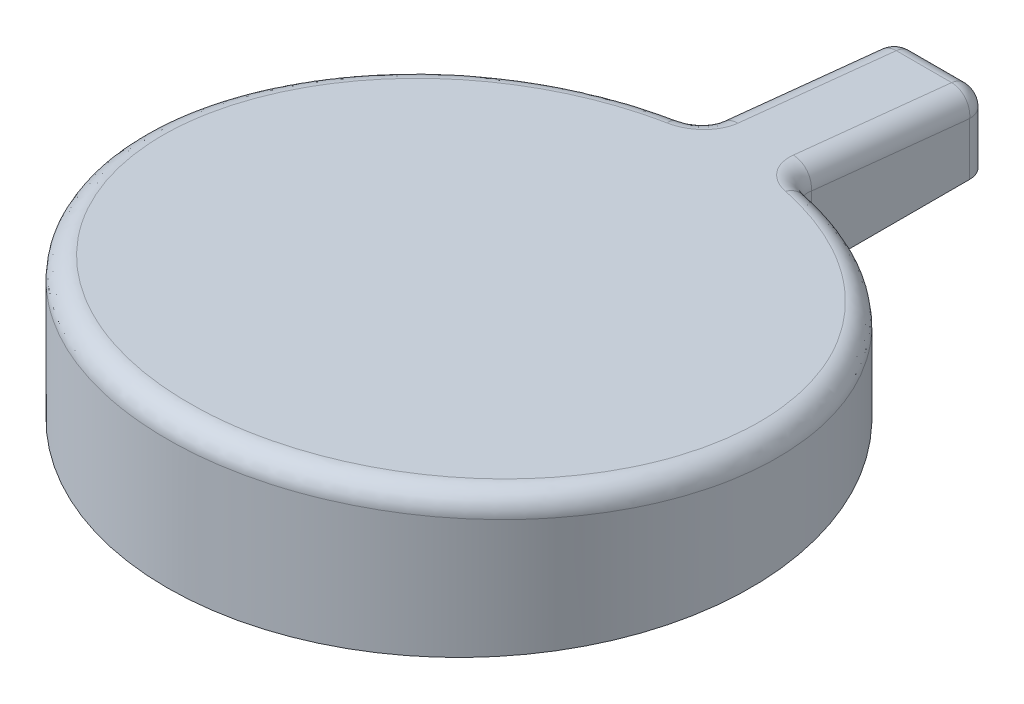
ISO-10303-21;
HEADER;
FILE_DESCRIPTION(('STEP AP214'),'2;1');
FILE_NAME('part.step','',(''),(''),'','','');
FILE_SCHEMA(('AUTOMOTIVE_DESIGN { 1 0 10303 214 1 1 1 1 }'));
ENDSEC;
DATA;
#1=APPLICATION_CONTEXT('core data for automotive mechanical design processes');
#2=APPLICATION_PROTOCOL_DEFINITION('international standard','automotive_design',2000,#1);
#3=PRODUCT_CONTEXT('',#1,'mechanical');
#4=PRODUCT('Part','Part','',(#3));
#5=PRODUCT_RELATED_PRODUCT_CATEGORY('part','',(#4));
#6=PRODUCT_DEFINITION_FORMATION('','',#4);
#7=PRODUCT_DEFINITION_CONTEXT('part definition',#1,'design');
#8=PRODUCT_DEFINITION('design','',#6,#7);
#9=PRODUCT_DEFINITION_SHAPE('','',#8);
#10=(LENGTH_UNIT() NAMED_UNIT(*) SI_UNIT(.MILLI.,.METRE.));
#11=(NAMED_UNIT(*) PLANE_ANGLE_UNIT() SI_UNIT($,.RADIAN.));
#12=(NAMED_UNIT(*) SI_UNIT($,.STERADIAN.) SOLID_ANGLE_UNIT());
#13=UNCERTAINTY_MEASURE_WITH_UNIT(LENGTH_MEASURE(1.E-05),#10,'distance_accuracy_value','');
#14=(GEOMETRIC_REPRESENTATION_CONTEXT(3) GLOBAL_UNCERTAINTY_ASSIGNED_CONTEXT((#13)) GLOBAL_UNIT_ASSIGNED_CONTEXT((#10,
#11,#12)) REPRESENTATION_CONTEXT('',''));
#15=CARTESIAN_POINT('',(0.,0.,0.));
#16=DIRECTION('',(0.,0.,1.));
#17=DIRECTION('',(1.,0.,0.));
#18=AXIS2_PLACEMENT_3D('',#15,#16,#17);
#19=CARTESIAN_POINT('',(0.,0.,0.));
#20=DIRECTION('',(0.,1.,0.));
#21=DIRECTION('',(1.,0.,0.));
#22=AXIS2_PLACEMENT_3D('',#19,#20,#21);
#23=PLANE('',#22);
#24=CARTESIAN_POINT('',(6.75,0.,-30.2561977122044));
#25=DIRECTION('',(0.,-1.,0.));
#26=DIRECTION('',(-0.78030184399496,0.,0.625403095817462));
#27=AXIS2_PLACEMENT_3D('',#24,#25,#26);
#28=CIRCLE('',#27,2.8);
#29=CARTESIAN_POINT('',(6.14032258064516,0.,-27.5233798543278));
#30=VERTEX_POINT('',#29);
#31=CARTESIAN_POINT('',(3.95,0.,-30.2561977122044));
#32=VERTEX_POINT('',#31);
#33=EDGE_CURVE('E609',#30,#32,#28,.T.);
#34=ORIENTED_EDGE('',*,*,#33,.T.);
#35=DIRECTION('',(0.,0.,-1.));
#36=VECTOR('',#35,1.);
#37=CARTESIAN_POINT('',(3.95,0.,-14.3041733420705));
#38=LINE('',#37,#36);
#39=CARTESIAN_POINT('',(3.95,0.,-45.9837971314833));
#40=VERTEX_POINT('',#39);
#41=EDGE_CURVE('E1317',#32,#40,#38,.T.);
#42=ORIENTED_EDGE('',*,*,#41,.T.);
#43=CARTESIAN_POINT('',(2.75,0.,-45.9837971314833));
#44=DIRECTION('',(0.,1.,0.));
#45=DIRECTION('',(0.707106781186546,0.,-0.70710678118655));
#46=AXIS2_PLACEMENT_3D('',#43,#44,#45);
#47=CIRCLE('',#46,1.2);
#48=CARTESIAN_POINT('',(2.75,0.,-47.1837971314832));
#49=VERTEX_POINT('',#48);
#50=EDGE_CURVE('E205',#40,#49,#47,.T.);
#51=ORIENTED_EDGE('',*,*,#50,.T.);
#52=DIRECTION('',(-1.,0.,0.));
#53=VECTOR('',#52,1.);
#54=CARTESIAN_POINT('',(2.375,0.,-47.1837971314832));
#55=LINE('',#54,#53);
#56=CARTESIAN_POINT('',(-2.75,0.,-47.1837971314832));
#57=VERTEX_POINT('',#56);
#58=EDGE_CURVE('E201',#49,#57,#55,.T.);
#59=ORIENTED_EDGE('',*,*,#58,.T.);
#60=CARTESIAN_POINT('',(-2.75,0.,-45.9837971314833));
#61=DIRECTION('',(0.,1.,0.));
#62=DIRECTION('',(-0.707106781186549,0.,-0.707106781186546));
#63=AXIS2_PLACEMENT_3D('',#60,#61,#62);
#64=CIRCLE('',#63,1.2);
#65=CARTESIAN_POINT('',(-3.95,0.,-45.9837971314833));
#66=VERTEX_POINT('',#65);
#67=EDGE_CURVE('E635',#57,#66,#64,.T.);
#68=ORIENTED_EDGE('',*,*,#67,.T.);
#69=DIRECTION('',(0.,0.,1.));
#70=VECTOR('',#69,1.);
#71=CARTESIAN_POINT('',(-3.95,0.,-23.9918985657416));
#72=LINE('',#71,#70);
#73=CARTESIAN_POINT('',(-3.95,0.,-30.2561977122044));
#74=VERTEX_POINT('',#73);
#75=EDGE_CURVE('E269',#66,#74,#72,.T.);
#76=ORIENTED_EDGE('',*,*,#75,.T.);
#77=CARTESIAN_POINT('',(-6.75,0.,-30.2561977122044));
#78=DIRECTION('',(0.,-1.,0.));
#79=DIRECTION('',(0.78030184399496,0.,0.625403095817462));
#80=AXIS2_PLACEMENT_3D('',#77,#78,#79);
#81=CIRCLE('',#80,2.8);
#82=CARTESIAN_POINT('',(-6.14032258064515,0.,-27.5233798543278));
#83=VERTEX_POINT('',#82);
#84=EDGE_CURVE('E258',#74,#83,#81,.T.);
#85=ORIENTED_EDGE('',*,*,#84,.T.);
#86=CARTESIAN_POINT('',(0.,0.,0.));
#87=DIRECTION('',(0.,1.,0.));
#88=DIRECTION('',(-1.,0.,0.));
#89=AXIS2_PLACEMENT_3D('',#86,#87,#88);
#90=CIRCLE('',#89,28.2);
#91=EDGE_CURVE('E869',#83,#30,#90,.T.);
#92=ORIENTED_EDGE('',*,*,#91,.T.);
#93=EDGE_LOOP('',(#34,#42,#51,#59,#68,#76,#85,#92));
#94=FACE_BOUND('',#93,.T.);
#95=CARTESIAN_POINT('',(-2.75,0.,-45.9837971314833));
#96=DIRECTION('',(0.,1.,0.));
#97=DIRECTION('',(-0.707106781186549,0.,-0.707106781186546));
#98=AXIS2_PLACEMENT_3D('',#95,#96,#97);
#99=CIRCLE('',#98,2.);
#100=CARTESIAN_POINT('',(-2.75,0.,-47.9837971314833));
#101=VERTEX_POINT('',#100);
#102=CARTESIAN_POINT('',(-4.75,0.,-45.9837971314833));
#103=VERTEX_POINT('',#102);
#104=EDGE_CURVE('E168',#101,#103,#99,.T.);
#105=ORIENTED_EDGE('',*,*,#104,.F.);
#106=DIRECTION('',(1.,0.,0.));
#107=VECTOR('',#106,1.);
#108=CARTESIAN_POINT('',(-4.75,0.,-47.9837971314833));
#109=LINE('',#108,#107);
#110=CARTESIAN_POINT('',(2.75,0.,-47.9837971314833));
#111=VERTEX_POINT('',#110);
#112=EDGE_CURVE('E285',#101,#111,#109,.T.);
#113=ORIENTED_EDGE('',*,*,#112,.T.);
#114=CARTESIAN_POINT('',(2.75,0.,-45.9837971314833));
#115=DIRECTION('',(0.,1.,0.));
#116=DIRECTION('',(0.707106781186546,0.,-0.707106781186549));
#117=AXIS2_PLACEMENT_3D('',#114,#115,#116);
#118=CIRCLE('',#117,2.);
#119=CARTESIAN_POINT('',(4.75,0.,-45.9837971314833));
#120=VERTEX_POINT('',#119);
#121=EDGE_CURVE('E284',#120,#111,#118,.T.);
#122=ORIENTED_EDGE('',*,*,#121,.F.);
#123=DIRECTION('',(0.,0.,1.));
#124=VECTOR('',#123,1.);
#125=CARTESIAN_POINT('',(4.75,0.,-47.9837971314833));
#126=LINE('',#125,#124);
#127=CARTESIAN_POINT('',(4.75,0.,-30.2561977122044));
#128=VERTEX_POINT('',#127);
#129=EDGE_CURVE('E27',#120,#128,#126,.T.);
#130=ORIENTED_EDGE('',*,*,#129,.T.);
#131=CARTESIAN_POINT('',(6.75,0.,-30.2561977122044));
#132=DIRECTION('',(0.,-1.,0.));
#133=DIRECTION('',(-0.78030184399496,0.,0.625403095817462));
#134=AXIS2_PLACEMENT_3D('',#131,#132,#133);
#135=CIRCLE('',#134,2.);
#136=CARTESIAN_POINT('',(6.31451612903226,0.,-28.3041849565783));
#137=VERTEX_POINT('',#136);
#138=EDGE_CURVE('E651',#137,#128,#135,.T.);
#139=ORIENTED_EDGE('',*,*,#138,.F.);
#140=CARTESIAN_POINT('',(0.,0.,0.));
#141=DIRECTION('',(0.,1.,0.));
#142=DIRECTION('',(-1.,0.,0.));
#143=AXIS2_PLACEMENT_3D('',#140,#141,#142);
#144=CIRCLE('',#143,29.);
#145=CARTESIAN_POINT('',(-6.31451612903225,0.,-28.3041849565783));
#146=VERTEX_POINT('',#145);
#147=EDGE_CURVE('E11',#146,#137,#144,.T.);
#148=ORIENTED_EDGE('',*,*,#147,.F.);
#149=CARTESIAN_POINT('',(-6.75,0.,-30.2561977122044));
#150=DIRECTION('',(0.,-1.,0.));
#151=DIRECTION('',(0.78030184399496,0.,0.625403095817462));
#152=AXIS2_PLACEMENT_3D('',#149,#150,#151);
#153=CIRCLE('',#152,2.);
#154=CARTESIAN_POINT('',(-4.75,0.,-30.2561977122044));
#155=VERTEX_POINT('',#154);
#156=EDGE_CURVE('E897',#155,#146,#153,.T.);
#157=ORIENTED_EDGE('',*,*,#156,.F.);
#158=DIRECTION('',(0.,0.,-1.));
#159=VECTOR('',#158,1.);
#160=CARTESIAN_POINT('',(-4.75,0.,17.494417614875));
#161=LINE('',#160,#159);
#162=EDGE_CURVE('E246',#155,#103,#161,.T.);
#163=ORIENTED_EDGE('',*,*,#162,.T.);
#164=EDGE_LOOP('',(#105,#113,#122,#130,#139,#148,#157,#163));
#165=FACE_BOUND('',#164,.T.);
#166=ADVANCED_FACE('F16',(#94,#165),#23,.F.);
#167=CARTESIAN_POINT('',(0.,0.,0.));
#168=DIRECTION('',(0.,1.,0.));
#169=DIRECTION('',(0.,0.,1.));
#170=AXIS2_PLACEMENT_3D('',#167,#168,#169);
#171=CYLINDRICAL_SURFACE('',#170,29.);
#172=CARTESIAN_POINT('',(-6.31451612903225,7.26324015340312,-28.3041849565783));
#173=CARTESIAN_POINT('',(-10.2529657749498,7.34786613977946,-27.4255373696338));
#174=CARTESIAN_POINT('',(-17.7494754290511,7.6777108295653,-24.0008536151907));
#175=CARTESIAN_POINT('',(-26.887284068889,8.66841311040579,-13.714673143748));
#176=CARTESIAN_POINT('',(-29.8536983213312,9.84528409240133,-1.49555591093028));
#177=CARTESIAN_POINT('',(-27.8940307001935,10.8752671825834,9.19846605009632));
#178=CARTESIAN_POINT('',(-24.3019093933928,11.5795186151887,16.510508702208));
#179=CARTESIAN_POINT('',(-18.8273923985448,12.1607723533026,22.5455012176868));
#180=CARTESIAN_POINT('',(-9.60753044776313,12.7152595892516,28.3025847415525));
#181=CARTESIAN_POINT('',(1.46320373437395,12.8649837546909,29.8571282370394));
#182=CARTESIAN_POINT('',(11.9066963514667,12.5749971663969,26.8462798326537));
#183=CARTESIAN_POINT('',(21.1480022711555,12.0241330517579,21.1268141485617));
#184=CARTESIAN_POINT('',(28.2140946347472,11.0219005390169,10.7209185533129));
#185=CARTESIAN_POINT('',(29.7048961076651,9.70494225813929,-2.95268532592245));
#186=CARTESIAN_POINT('',(25.9649079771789,8.56966008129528,-14.7399978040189));
#187=CARTESIAN_POINT('',(17.7548910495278,7.67751988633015,-24.0028361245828));
#188=CARTESIAN_POINT('',(10.2529657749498,7.34786613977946,-27.4255373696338));
#189=CARTESIAN_POINT('',(6.31451612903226,7.26324015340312,-28.3041849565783));
#190=(BOUNDED_CURVE() B_SPLINE_CURVE(3,(#172,#173,#174,#175,#176,#177,#178,#179,#180,#181,#182,
#183,#184,#185,#186,#187,#188,#189),.UNSPECIFIED.,.F.,.F.) B_SPLINE_CURVE_WITH_KNOTS((4,1,1,1,1,
1,1,1,1,1,1,1,1,1,1,4),(-2.92209235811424,-2.50465059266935,-2.08720882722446,-1.53061980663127,
-1.25232529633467,-0.974030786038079,-0.695736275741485,-0.417441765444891,0.139147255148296,
0.41744176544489,0.695736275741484,1.25232529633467,1.66976706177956,2.08720882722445,
2.50465059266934,2.92209235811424),
.UNSPECIFIED.) CURVE() GEOMETRIC_REPRESENTATION_ITEM() RATIONAL_B_SPLINE_CURVE((1.,1.,1.,1.,1.,
1.,1.,1.,1.,1.,1.,1.,1.,1.,1.,1.,1.,1.)) REPRESENTATION_ITEM(''));
#191=CARTESIAN_POINT('',(-6.31451612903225,7.26324015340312,-28.3041849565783));
#192=VERTEX_POINT('',#191);
#193=CARTESIAN_POINT('',(6.31451612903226,7.26324015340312,-28.3041849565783));
#194=VERTEX_POINT('',#193);
#195=EDGE_CURVE('E292',#192,#194,#190,.T.);
#196=ORIENTED_EDGE('',*,*,#195,.F.);
#197=DIRECTION('',(0.,1.,0.));
#198=VECTOR('',#197,1.);
#199=CARTESIAN_POINT('',(-6.31451612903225,0.,-28.3041849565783));
#200=LINE('',#199,#198);
#201=EDGE_CURVE('E257',#146,#192,#200,.T.);
#202=ORIENTED_EDGE('',*,*,#201,.F.);
#203=ORIENTED_EDGE('',*,*,#147,.T.);
#204=DIRECTION('',(0.,-1.,0.));
#205=VECTOR('',#204,1.);
#206=CARTESIAN_POINT('',(6.31451612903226,0.,-28.3041849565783));
#207=LINE('',#206,#205);
#208=EDGE_CURVE('E644',#194,#137,#207,.T.);
#209=ORIENTED_EDGE('',*,*,#208,.F.);
#210=EDGE_LOOP('',(#196,#202,#203,#209));
#211=FACE_BOUND('',#210,.T.);
#212=ADVANCED_FACE('F316',(#211),#171,.T.);
#213=CARTESIAN_POINT('',(4.75,0.,-28.608346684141));
#214=DIRECTION('',(1.,0.,0.));
#215=DIRECTION('',(0.,0.,1.));
#216=AXIS2_PLACEMENT_3D('',#213,#214,#215);
#217=PLANE('',#216);
#218=DIRECTION('',(0.,-0.102899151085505,-0.994691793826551));
#219=VECTOR('',#218,1.);
#220=CARTESIAN_POINT('',(4.75,9.98301278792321,-0.0610367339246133));
#221=LINE('',#220,#219);
#222=CARTESIAN_POINT('',(4.75,6.85937544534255,-30.2561977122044));
#223=VERTEX_POINT('',#222);
#224=CARTESIAN_POINT('',(4.75,5.23238240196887,-45.9837971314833));
#225=VERTEX_POINT('',#224);
#226=EDGE_CURVE('E604',#223,#225,#221,.T.);
#227=ORIENTED_EDGE('',*,*,#226,.F.);
#228=DIRECTION('',(0.,1.,0.));
#229=VECTOR('',#228,1.);
#230=CARTESIAN_POINT('',(4.75,0.,-30.2561977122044));
#231=LINE('',#230,#229);
#232=EDGE_CURVE('E658',#128,#223,#231,.T.);
#233=ORIENTED_EDGE('',*,*,#232,.F.);
#234=ORIENTED_EDGE('',*,*,#129,.F.);
#235=DIRECTION('',(0.,-1.,0.));
#236=VECTOR('',#235,1.);
#237=CARTESIAN_POINT('',(4.75,0.,-45.9837971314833));
#238=LINE('',#237,#236);
#239=EDGE_CURVE('E280',#225,#120,#238,.T.);
#240=ORIENTED_EDGE('',*,*,#239,.F.);
#241=EDGE_LOOP('',(#227,#233,#234,#240));
#242=FACE_BOUND('',#241,.T.);
#243=ADVANCED_FACE('F435',(#242),#217,.T.);
#244=CARTESIAN_POINT('',(6.75,0.,-30.2561977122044));
#245=DIRECTION('',(0.,1.,0.));
#246=DIRECTION('',(-0.78030184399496,0.,0.625403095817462));
#247=AXIS2_PLACEMENT_3D('',#244,#245,#246);
#248=CYLINDRICAL_SURFACE('',#247,2.);
#249=CARTESIAN_POINT('',(6.31451612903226,7.26324015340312,-28.3041849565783));
#250=CARTESIAN_POINT('',(5.81208811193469,7.24004931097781,-28.4162740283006));
#251=CARTESIAN_POINT('',(5.01751724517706,7.12586155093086,-28.9681815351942));
#252=CARTESIAN_POINT('',(4.75,6.9392550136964,-29.8701131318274));
#253=CARTESIAN_POINT('',(4.75,6.85937544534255,-30.2561977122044));
#254=(BOUNDED_CURVE() B_SPLINE_CURVE(3,(#249,#250,#251,#252,#253),.UNSPECIFIED.,.F.,
.F.) B_SPLINE_CURVE_WITH_KNOTS((4,1,4),(-1.57079632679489,-0.798627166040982,
-0.219500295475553),
.UNSPECIFIED.) CURVE() GEOMETRIC_REPRESENTATION_ITEM() RATIONAL_B_SPLINE_CURVE((1.,1.,1.,1.,1.)) REPRESENTATION_ITEM(''));
#255=EDGE_CURVE('E350',#194,#223,#254,.T.);
#256=ORIENTED_EDGE('',*,*,#255,.F.);
#257=ORIENTED_EDGE('',*,*,#208,.T.);
#258=ORIENTED_EDGE('',*,*,#138,.T.);
#259=ORIENTED_EDGE('',*,*,#232,.T.);
#260=EDGE_LOOP('',(#256,#257,#258,#259));
#261=FACE_BOUND('',#260,.T.);
#262=ADVANCED_FACE('F737',(#261),#248,.F.);
#263=CARTESIAN_POINT('',(2.75,0.,-45.9837971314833));
#264=DIRECTION('',(0.,1.,0.));
#265=DIRECTION('',(0.707106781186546,0.,-0.707106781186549));
#266=AXIS2_PLACEMENT_3D('',#263,#264,#265);
#267=CYLINDRICAL_SURFACE('',#266,2.);
#268=CARTESIAN_POINT('',(2.75,5.23238240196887,-45.9837971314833));
#269=DIRECTION('',(0.,1.,0.));
#270=DIRECTION('',(0.707106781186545,0.,-0.70710678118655));
#271=AXIS2_PLACEMENT_3D('',#268,#269,#270);
#272=CIRCLE('',#271,2.);
#273=CARTESIAN_POINT('',(2.75,5.23238240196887,-47.9837971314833));
#274=VERTEX_POINT('',#273);
#275=EDGE_CURVE('E597',#225,#274,#272,.T.);
#276=ORIENTED_EDGE('',*,*,#275,.F.);
#277=ORIENTED_EDGE('',*,*,#239,.T.);
#278=ORIENTED_EDGE('',*,*,#121,.T.);
#279=DIRECTION('',(0.,1.,0.));
#280=VECTOR('',#279,1.);
#281=CARTESIAN_POINT('',(2.75,0.,-47.9837971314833));
#282=LINE('',#281,#280);
#283=EDGE_CURVE('E605',#111,#274,#282,.T.);
#284=ORIENTED_EDGE('',*,*,#283,.T.);
#285=EDGE_LOOP('',(#276,#277,#278,#284));
#286=FACE_BOUND('',#285,.T.);
#287=ADVANCED_FACE('F734',(#286),#267,.T.);
#288=CARTESIAN_POINT('',(0.,15.,29.));
#289=DIRECTION('',(0.,-0.994691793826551,0.102899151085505));
#290=DIRECTION('',(-1.,0.,0.));
#291=AXIS2_PLACEMENT_3D('',#288,#289,#290);
#292=PLANE('',#291);
#293=CARTESIAN_POINT('',(-6.75,8.84875903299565,-30.4619960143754));
#294=DIRECTION('',(0.,0.994691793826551,-0.102899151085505));
#295=DIRECTION('',(0.,0.102899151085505,0.994691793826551));
#296=AXIS2_PLACEMENT_3D('',#293,#294,#295);
#297=ELLIPSE('',#296,4.02134613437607,4.);
#298=CARTESIAN_POINT('',(-5.87903225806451,9.25262374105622,-26.5579705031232));
#299=VERTEX_POINT('',#298);
#300=CARTESIAN_POINT('',(-2.75,8.84875903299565,-30.4619960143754));
#301=VERTEX_POINT('',#300);
#302=EDGE_CURVE('E1420',#299,#301,#297,.T.);
#303=ORIENTED_EDGE('',*,*,#302,.F.);
#304=CARTESIAN_POINT('',(0.,11.9787105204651,-0.20579830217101));
#305=DIRECTION('',(0.,-0.994691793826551,0.102899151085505));
#306=DIRECTION('',(0.,0.102899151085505,0.994691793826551));
#307=AXIS2_PLACEMENT_3D('',#304,#305,#306);
#308=ELLIPSE('',#307,27.1440864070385,27.);
#309=CARTESIAN_POINT('',(5.87903225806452,9.25262374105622,-26.5579705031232));
#310=VERTEX_POINT('',#309);
#311=EDGE_CURVE('E333',#310,#299,#308,.T.);
#312=ORIENTED_EDGE('',*,*,#311,.F.);
#313=CARTESIAN_POINT('',(6.75,8.84875903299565,-30.4619960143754));
#314=DIRECTION('',(0.,0.994691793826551,-0.102899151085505));
#315=DIRECTION('',(0.,0.102899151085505,0.994691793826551));
#316=AXIS2_PLACEMENT_3D('',#313,#314,#315);
#317=ELLIPSE('',#316,4.02134613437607,4.);
#318=CARTESIAN_POINT('',(2.75,8.84875903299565,-30.4619960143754));
#319=VERTEX_POINT('',#318);
#320=EDGE_CURVE('E397',#319,#310,#317,.T.);
#321=ORIENTED_EDGE('',*,*,#320,.F.);
#322=DIRECTION('',(0.,0.102899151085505,0.994691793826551));
#323=VECTOR('',#322,1.);
#324=CARTESIAN_POINT('',(2.75,11.9723963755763,-0.266835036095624));
#325=LINE('',#324,#323);
#326=CARTESIAN_POINT('',(2.75,7.22176598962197,-46.1895954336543));
#327=VERTEX_POINT('',#326);
#328=EDGE_CURVE('E603',#327,#319,#325,.T.);
#329=ORIENTED_EDGE('',*,*,#328,.F.);
#330=DIRECTION('',(1.,0.,0.));
#331=VECTOR('',#330,1.);
#332=CARTESIAN_POINT('',(2.375,7.22176598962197,-46.1895954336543));
#333=LINE('',#332,#331);
#334=CARTESIAN_POINT('',(-2.75,7.22176598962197,-46.1895954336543));
#335=VERTEX_POINT('',#334);
#336=EDGE_CURVE('E940',#335,#327,#333,.T.);
#337=ORIENTED_EDGE('',*,*,#336,.F.);
#338=DIRECTION('',(0.,-0.102899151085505,-0.994691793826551));
#339=VECTOR('',#338,1.);
#340=CARTESIAN_POINT('',(-2.75,10.9808292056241,-9.85198434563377));
#341=LINE('',#340,#339);
#342=EDGE_CURVE('E718',#301,#335,#341,.T.);
#343=ORIENTED_EDGE('',*,*,#342,.F.);
#344=EDGE_LOOP('',(#303,#312,#321,#329,#337,#343));
#345=FACE_BOUND('',#344,.T.);
#346=ADVANCED_FACE('F736',(#345),#292,.F.);
#347=CARTESIAN_POINT('',(4.75,0.,-47.9837971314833));
#348=DIRECTION('',(0.,0.,-1.));
#349=DIRECTION('',(0.,-1.,0.));
#350=AXIS2_PLACEMENT_3D('',#347,#348,#349);
#351=PLANE('',#350);
#352=DIRECTION('',(-1.,0.,0.));
#353=VECTOR('',#352,1.);
#354=CARTESIAN_POINT('',(2.375,5.23238240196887,-47.9837971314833));
#355=LINE('',#354,#353);
#356=CARTESIAN_POINT('',(-2.75,5.23238240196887,-47.9837971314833));
#357=VERTEX_POINT('',#356);
#358=EDGE_CURVE('E925',#274,#357,#355,.T.);
#359=ORIENTED_EDGE('',*,*,#358,.F.);
#360=ORIENTED_EDGE('',*,*,#283,.F.);
#361=ORIENTED_EDGE('',*,*,#112,.F.);
#362=DIRECTION('',(0.,-1.,0.));
#363=VECTOR('',#362,1.);
#364=CARTESIAN_POINT('',(-2.75,0.,-47.9837971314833));
#365=LINE('',#364,#363);
#366=EDGE_CURVE('E274',#357,#101,#365,.T.);
#367=ORIENTED_EDGE('',*,*,#366,.F.);
#368=EDGE_LOOP('',(#359,#360,#361,#367));
#369=FACE_BOUND('',#368,.T.);
#370=ADVANCED_FACE('F743',(#369),#351,.T.);
#371=CARTESIAN_POINT('',(-2.75,0.,-45.9837971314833));
#372=DIRECTION('',(0.,1.,0.));
#373=DIRECTION('',(-0.707106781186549,0.,-0.707106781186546));
#374=AXIS2_PLACEMENT_3D('',#371,#372,#373);
#375=CYLINDRICAL_SURFACE('',#374,2.);
#376=CARTESIAN_POINT('',(-2.75,5.23238240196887,-45.9837971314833));
#377=DIRECTION('',(0.,1.,0.));
#378=DIRECTION('',(-0.707106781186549,0.,-0.707106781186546));
#379=AXIS2_PLACEMENT_3D('',#376,#377,#378);
#380=CIRCLE('',#379,2.);
#381=CARTESIAN_POINT('',(-4.75,5.23238240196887,-45.9837971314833));
#382=VERTEX_POINT('',#381);
#383=EDGE_CURVE('E946',#357,#382,#380,.T.);
#384=ORIENTED_EDGE('',*,*,#383,.F.);
#385=ORIENTED_EDGE('',*,*,#366,.T.);
#386=ORIENTED_EDGE('',*,*,#104,.T.);
#387=DIRECTION('',(0.,1.,0.));
#388=VECTOR('',#387,1.);
#389=CARTESIAN_POINT('',(-4.75,0.,-45.9837971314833));
#390=LINE('',#389,#388);
#391=EDGE_CURVE('E254',#103,#382,#390,.T.);
#392=ORIENTED_EDGE('',*,*,#391,.T.);
#393=EDGE_LOOP('',(#384,#385,#386,#392));
#394=FACE_BOUND('',#393,.T.);
#395=ADVANCED_FACE('F732',(#394),#375,.T.);
#396=CARTESIAN_POINT('',(-4.75,0.,-47.9837971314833));
#397=DIRECTION('',(-1.,0.,0.));
#398=DIRECTION('',(0.,0.,1.));
#399=AXIS2_PLACEMENT_3D('',#396,#397,#398);
#400=PLANE('',#399);
#401=DIRECTION('',(0.,0.102899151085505,0.994691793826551));
#402=VECTOR('',#401,1.);
#403=CARTESIAN_POINT('',(-4.75,8.99144561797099,-9.64618604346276));
#404=LINE('',#403,#402);
#405=CARTESIAN_POINT('',(-4.75,6.85937544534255,-30.2561977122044));
#406=VERTEX_POINT('',#405);
#407=EDGE_CURVE('E252',#382,#406,#404,.T.);
#408=ORIENTED_EDGE('',*,*,#407,.F.);
#409=ORIENTED_EDGE('',*,*,#391,.F.);
#410=ORIENTED_EDGE('',*,*,#162,.F.);
#411=DIRECTION('',(0.,-1.,0.));
#412=VECTOR('',#411,1.);
#413=CARTESIAN_POINT('',(-4.75,0.,-30.2561977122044));
#414=LINE('',#413,#412);
#415=EDGE_CURVE('E888',#406,#155,#414,.T.);
#416=ORIENTED_EDGE('',*,*,#415,.F.);
#417=EDGE_LOOP('',(#408,#409,#410,#416));
#418=FACE_BOUND('',#417,.T.);
#419=ADVANCED_FACE('F729',(#418),#400,.T.);
#420=CARTESIAN_POINT('',(-6.75,0.,-30.2561977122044));
#421=DIRECTION('',(0.,-1.,0.));
#422=DIRECTION('',(0.78030184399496,0.,0.625403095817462));
#423=AXIS2_PLACEMENT_3D('',#420,#421,#422);
#424=CYLINDRICAL_SURFACE('',#423,2.);
#425=CARTESIAN_POINT('',(-4.75,6.85937544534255,-30.2561977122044));
#426=CARTESIAN_POINT('',(-4.75,6.96588153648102,-29.7414182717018));
#427=CARTESIAN_POINT('',(-5.11565384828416,7.15119456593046,-28.8457386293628));
#428=CARTESIAN_POINT('',(-5.93769511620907,7.24584702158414,-28.38825176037));
#429=CARTESIAN_POINT('',(-6.31451612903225,7.26324015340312,-28.3041849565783));
#430=(BOUNDED_CURVE() B_SPLINE_CURVE(3,(#425,#426,#427,#428,#429),.UNSPECIFIED.,.F.,
.F.) B_SPLINE_CURVE_WITH_KNOTS((4,1,4),(0.219500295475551,0.991669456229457,1.57079632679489),
.UNSPECIFIED.) CURVE() GEOMETRIC_REPRESENTATION_ITEM() RATIONAL_B_SPLINE_CURVE((1.,1.,1.,1.,1.)) REPRESENTATION_ITEM(''));
#431=EDGE_CURVE('E253',#406,#192,#430,.T.);
#432=ORIENTED_EDGE('',*,*,#431,.F.);
#433=ORIENTED_EDGE('',*,*,#415,.T.);
#434=ORIENTED_EDGE('',*,*,#156,.T.);
#435=ORIENTED_EDGE('',*,*,#201,.T.);
#436=EDGE_LOOP('',(#432,#433,#434,#435));
#437=FACE_BOUND('',#436,.T.);
#438=ADVANCED_FACE('F731',(#437),#424,.F.);
#439=CARTESIAN_POINT('',(2.75,5.23238240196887,-45.9837971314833));
#440=DIRECTION('',(0.373162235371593,-0.831485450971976,-0.411560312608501));
#441=DIRECTION('',(0.558511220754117,0.555546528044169,-0.615981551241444));
#442=AXIS2_PLACEMENT_3D('',#439,#440,#441);
#443=SPHERICAL_SURFACE('',#442,2.);
#444=CARTESIAN_POINT('',(2.75,5.23238240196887,-45.9837971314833));
#445=DIRECTION('',(0.,0.102899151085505,0.994691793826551));
#446=DIRECTION('',(1.,0.,0.));
#447=AXIS2_PLACEMENT_3D('',#444,#445,#446);
#448=CIRCLE('',#447,2.);
#449=EDGE_CURVE('E599',#225,#327,#448,.T.);
#450=ORIENTED_EDGE('',*,*,#449,.F.);
#451=ORIENTED_EDGE('',*,*,#275,.T.);
#452=CARTESIAN_POINT('',(2.75,5.23238240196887,-45.9837971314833));
#453=DIRECTION('',(-1.,0.,0.));
#454=DIRECTION('',(0.,0.994691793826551,-0.102899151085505));
#455=AXIS2_PLACEMENT_3D('',#452,#453,#454);
#456=CIRCLE('',#455,2.);
#457=EDGE_CURVE('E342',#327,#274,#456,.T.);
#458=ORIENTED_EDGE('',*,*,#457,.F.);
#459=EDGE_LOOP('',(#450,#451,#458));
#460=FACE_BOUND('',#459,.T.);
#461=ADVANCED_FACE('F847',(#460),#443,.T.);
#462=CARTESIAN_POINT('',(-2.75,5.23238240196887,-45.9837971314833));
#463=DIRECTION('',(-0.373162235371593,-0.831485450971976,-0.411560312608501));
#464=DIRECTION('',(-0.558511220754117,0.555546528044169,-0.615981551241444));
#465=AXIS2_PLACEMENT_3D('',#462,#463,#464);
#466=SPHERICAL_SURFACE('',#465,2.);
#467=CARTESIAN_POINT('',(-2.75,5.23238240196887,-45.9837971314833));
#468=DIRECTION('',(1.,0.,0.));
#469=DIRECTION('',(0.,0.,-1.));
#470=AXIS2_PLACEMENT_3D('',#467,#468,#469);
#471=CIRCLE('',#470,2.);
#472=EDGE_CURVE('E933',#357,#335,#471,.T.);
#473=ORIENTED_EDGE('',*,*,#472,.F.);
#474=ORIENTED_EDGE('',*,*,#383,.T.);
#475=CARTESIAN_POINT('',(-2.75,5.23238240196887,-45.9837971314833));
#476=DIRECTION('',(0.,0.102899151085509,0.994691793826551));
#477=DIRECTION('',(0.,0.994691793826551,-0.102899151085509));
#478=AXIS2_PLACEMENT_3D('',#475,#476,#477);
#479=CIRCLE('',#478,2.);
#480=EDGE_CURVE('E248',#335,#382,#479,.T.);
#481=ORIENTED_EDGE('',*,*,#480,.F.);
#482=EDGE_LOOP('',(#473,#474,#481));
#483=FACE_BOUND('',#482,.T.);
#484=ADVANCED_FACE('F428',(#483),#466,.T.);
#485=CARTESIAN_POINT('',(2.375,5.23238240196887,-45.9837971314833));
#486=DIRECTION('',(-1.,0.,0.));
#487=DIRECTION('',(0.,0.669739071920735,-0.742596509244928));
#488=AXIS2_PLACEMENT_3D('',#485,#486,#487);
#489=CYLINDRICAL_SURFACE('',#488,2.);
#490=ORIENTED_EDGE('',*,*,#457,.T.);
#491=ORIENTED_EDGE('',*,*,#358,.T.);
#492=ORIENTED_EDGE('',*,*,#472,.T.);
#493=ORIENTED_EDGE('',*,*,#336,.T.);
#494=EDGE_LOOP('',(#490,#491,#492,#493));
#495=FACE_BOUND('',#494,.T.);
#496=ADVANCED_FACE('F312',(#495),#489,.T.);
#497=CARTESIAN_POINT('',(5.87903225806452,9.25262374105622,-26.5579705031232));
#498=CARTESIAN_POINT('',(9.54586468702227,9.33724972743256,-25.7399193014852));
#499=CARTESIAN_POINT('',(16.5304158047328,9.66690347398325,-22.5532664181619));
#500=CARTESIAN_POINT('',(24.174224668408,10.5590436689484,-13.929244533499));
#501=CARTESIAN_POINT('',(27.6562825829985,11.6943258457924,-2.9548501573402));
#502=CARTESIAN_POINT('',(26.2682950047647,13.01128412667,9.77574655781));
#503=CARTESIAN_POINT('',(19.6895193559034,14.013516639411,19.4639941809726));
#504=CARTESIAN_POINT('',(11.0855448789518,14.56438075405,24.7890139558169));
#505=CARTESIAN_POINT('',(1.36229313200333,14.854367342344,27.5922176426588));
#506=CARTESIAN_POINT('',(-8.94494214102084,14.7046431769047,26.1448840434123));
#507=CARTESIAN_POINT('',(-17.5289515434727,14.1501559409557,20.7848407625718));
#508=CARTESIAN_POINT('',(-22.6259156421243,13.5689022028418,15.1660546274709));
#509=CARTESIAN_POINT('',(-25.9703044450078,12.8646507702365,8.35829077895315));
#510=CARTESIAN_POINT('',(-27.7948225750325,11.8346676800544,-1.59821242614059));
#511=CARTESIAN_POINT('',(-25.0329886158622,10.6577966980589,-12.974631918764));
#512=CARTESIAN_POINT('',(-16.5253736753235,9.66709441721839,-22.5514206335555));
#513=CARTESIAN_POINT('',(-9.54586468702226,9.33724972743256,-25.7399193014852));
#514=CARTESIAN_POINT('',(-5.87903225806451,9.25262374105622,-26.5579705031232));
#515=CARTESIAN_POINT('',(5.94031800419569,9.22450665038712,-26.8297690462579));
#516=CARTESIAN_POINT('',(9.64549946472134,9.30995652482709,-26.0037718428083));
#517=CARTESIAN_POINT('',(16.7037306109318,9.64280879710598,-22.7861526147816));
#518=CARTESIAN_POINT('',(24.4330086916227,10.5438922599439,-14.0756988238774));
#519=CARTESIAN_POINT('',(27.9604724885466,11.6911076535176,-2.98593413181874));
#520=CARTESIAN_POINT('',(26.5670909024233,13.0227169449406,9.88624679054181));
#521=CARTESIAN_POINT('',(19.9194957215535,14.0368991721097,19.6900195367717));
#522=CARTESIAN_POINT('',(11.2166620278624,14.5945815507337,25.0809297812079));
#523=CARTESIAN_POINT('',(1.37873566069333,14.8882229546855,27.919469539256));
#524=CARTESIAN_POINT('',(-9.05153460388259,14.7365881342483,26.4536525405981));
#525=CARTESIAN_POINT('',(-17.734038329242,14.175232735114,21.0272257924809));
#526=CARTESIAN_POINT('',(-22.8866920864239,13.5869757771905,15.3407794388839));
#527=CARTESIAN_POINT('',(-26.2643750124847,12.8745210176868,8.45370381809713));
#528=CARTESIAN_POINT('',(-28.1017482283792,11.8329625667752,-1.61469465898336));
#529=CARTESIAN_POINT('',(-25.3013152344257,10.6436270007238,-13.1115785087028));
#530=CARTESIAN_POINT('',(-16.6986612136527,9.64300503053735,-22.7842583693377));
#531=CARTESIAN_POINT('',(-9.64549946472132,9.30995652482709,-26.0037718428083));
#532=CARTESIAN_POINT('',(-5.94031800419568,9.22450665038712,-26.8297690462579));
#533=CARTESIAN_POINT('',(6.06274232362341,9.0493308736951,-27.3604021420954));
#534=CARTESIAN_POINT('',(9.84453840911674,9.13590775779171,-26.518472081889));
#535=CARTESIAN_POINT('',(17.0499288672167,9.47315884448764,-23.2387731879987));
#536=CARTESIAN_POINT('',(24.9498894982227,10.3865887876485,-14.355065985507));
#537=CARTESIAN_POINT('',(28.5679540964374,11.5504438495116,-3.03411628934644));
#538=CARTESIAN_POINT('',(27.1637023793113,12.9026934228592,10.1216792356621));
#539=CARTESIAN_POINT('',(20.3786260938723,13.9339409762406,20.1567530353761));
#540=CARTESIAN_POINT('',(11.4784117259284,14.5014217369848,25.6795584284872));
#541=CARTESIAN_POINT('',(1.41155450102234,14.80033632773,28.588819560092));
#542=CARTESIAN_POINT('',(-9.26431240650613,14.6459362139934,27.0860162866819));
#543=CARTESIAN_POINT('',(-18.1434746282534,14.0747069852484,21.5267095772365));
#544=CARTESIAN_POINT('',(-23.4073515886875,13.4764395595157,15.7047957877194));
#545=CARTESIAN_POINT('',(-26.8515624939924,12.7523181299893,8.65890294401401));
#546=CARTESIAN_POINT('',(-28.7146838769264,11.6944125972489,-1.63361790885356));
#547=CARTESIAN_POINT('',(-25.8372494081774,10.4876810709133,-13.3718887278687));
#548=CARTESIAN_POINT('',(-17.0448056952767,9.47336271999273,-23.2367821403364));
#549=CARTESIAN_POINT('',(-9.84453840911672,9.13590775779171,-26.518472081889));
#550=CARTESIAN_POINT('',(-6.06274232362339,9.0493308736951,-27.3604021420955));
#551=CARTESIAN_POINT('',(6.24014379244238,8.38110202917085,-28.0864593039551));
#552=CARTESIAN_POINT('',(10.132694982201,8.46774139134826,-27.2206076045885));
#553=CARTESIAN_POINT('',(17.5502701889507,8.80523813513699,-23.8476224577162));
#554=CARTESIAN_POINT('',(25.6894462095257,9.7194319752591,-14.7075369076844));
#555=CARTESIAN_POINT('',(29.4260713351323,10.8844733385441,-3.05221971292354));
#556=CARTESIAN_POINT('',(27.9930782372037,12.2384159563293,10.5028770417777));
#557=CARTESIAN_POINT('',(21.0089252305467,13.2712850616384,20.8531303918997));
#558=CARTESIAN_POINT('',(11.8355957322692,13.8397630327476,26.5525394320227));
#559=CARTESIAN_POINT('',(1.45593035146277,14.1392319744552,29.5557087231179));
#560=CARTESIAN_POINT('',(-9.55368537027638,13.9845345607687,28.0040651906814));
#561=CARTESIAN_POINT('',(-18.7051023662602,13.4122988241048,22.2668979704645));
#562=CARTESIAN_POINT('',(-24.1266209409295,12.8130626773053,16.2613111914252));
#563=CARTESIAN_POINT('',(-27.6695881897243,12.0878813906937,8.99663450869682));
#564=CARTESIAN_POINT('',(-29.5788549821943,11.0286015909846,-1.60989648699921));
#565=CARTESIAN_POINT('',(-26.6036264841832,9.82060683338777,-13.69605720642));
#566=CARTESIAN_POINT('',(-17.5450221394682,8.80544331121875,-23.84553170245));
#567=CARTESIAN_POINT('',(-10.132694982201,8.46774139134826,-27.2206076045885));
#568=CARTESIAN_POINT('',(-6.24014379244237,8.38110202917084,-28.0864593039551));
#569=CARTESIAN_POINT('',(6.30528371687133,7.68318977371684,-28.3062446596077));
#570=CARTESIAN_POINT('',(10.2384772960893,7.76858192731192,-27.4301345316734));
#571=CARTESIAN_POINT('',(17.7312498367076,8.10119755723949,-24.0174929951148));
#572=CARTESIAN_POINT('',(25.9433928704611,9.0016980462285,-14.7751467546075));
#573=CARTESIAN_POINT('',(29.6995467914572,10.1482606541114,-3.00089296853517));
#574=CARTESIAN_POINT('',(28.2323254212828,11.4792598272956,10.6761756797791));
#575=CARTESIAN_POINT('',(21.1755120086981,12.4931237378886,21.1027506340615));
#576=CARTESIAN_POINT('',(11.9259661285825,13.0506836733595,26.839101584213));
#577=CARTESIAN_POINT('',(1.46629439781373,13.3442718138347,29.8602681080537));
#578=CARTESIAN_POINT('',(-9.6248182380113,13.1926612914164,28.2998990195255));
#579=CARTESIAN_POINT('',(-18.8526699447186,12.6314291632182,22.5257027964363));
#580=CARTESIAN_POINT('',(-24.325487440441,12.0433369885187,16.4770758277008));
#581=CARTESIAN_POINT('',(-27.9088571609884,11.3311434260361,9.1548835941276));
#582=CARTESIAN_POINT('',(-29.8512441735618,10.2900436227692,-1.5444896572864));
#583=CARTESIAN_POINT('',(-26.865799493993,9.10136522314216,-13.7522741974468));
#584=CARTESIAN_POINT('',(-17.7259184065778,8.10139435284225,-24.0154390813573));
#585=CARTESIAN_POINT('',(-10.2384772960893,7.76858192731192,-27.4301345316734));
#586=CARTESIAN_POINT('',(-6.30528371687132,7.68318977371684,-28.3062446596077));
#587=CARTESIAN_POINT('',(6.31451612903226,7.26324015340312,-28.3041849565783));
#588=CARTESIAN_POINT('',(10.2529657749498,7.34786613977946,-27.4255373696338));
#589=CARTESIAN_POINT('',(17.7548910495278,7.67751988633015,-24.0028361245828));
#590=CARTESIAN_POINT('',(25.9649079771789,8.56966008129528,-14.7399978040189));
#591=CARTESIAN_POINT('',(29.7048961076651,9.70494225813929,-2.95268532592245));
#592=CARTESIAN_POINT('',(28.2140946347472,11.0219005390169,10.7209185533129));
#593=CARTESIAN_POINT('',(21.1480022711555,12.0241330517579,21.1268141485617));
#594=CARTESIAN_POINT('',(11.9066963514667,12.5749971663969,26.8462798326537));
#595=CARTESIAN_POINT('',(1.46320373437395,12.8649837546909,29.8571282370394));
#596=CARTESIAN_POINT('',(-9.60753044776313,12.7152595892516,28.3025847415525));
#597=CARTESIAN_POINT('',(-18.8273923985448,12.1607723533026,22.5455012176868));
#598=CARTESIAN_POINT('',(-24.3019093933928,11.5795186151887,16.510508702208));
#599=CARTESIAN_POINT('',(-27.8940307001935,10.8752671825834,9.19846605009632));
#600=CARTESIAN_POINT('',(-29.8536983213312,9.84528409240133,-1.49555591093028));
#601=CARTESIAN_POINT('',(-26.887284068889,8.66841311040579,-13.714673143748));
#602=CARTESIAN_POINT('',(-17.7494754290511,7.6777108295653,-24.0008536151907));
#603=CARTESIAN_POINT('',(-10.2529657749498,7.34786613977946,-27.4255373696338));
#604=CARTESIAN_POINT('',(-6.31451612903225,7.26324015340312,-28.3041849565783));
#605=(BOUNDED_SURFACE() B_SPLINE_SURFACE(3,3,((#497,#498,#499,#500,#501,#502,#503,#504,#505,
#506,#507,#508,#509,#510,#511,#512,#513,#514),(#515,#516,#517,#518,#519,#520,#521,#522,#523,
#524,#525,#526,#527,#528,#529,#530,#531,#532),(#533,#534,#535,#536,#537,#538,#539,#540,#541,
#542,#543,#544,#545,#546,#547,#548,#549,#550),(#551,#552,#553,#554,#555,#556,#557,#558,#559,
#560,#561,#562,#563,#564,#565,#566,#567,#568),(#569,#570,#571,#572,#573,#574,#575,#576,#577,
#578,#579,#580,#581,#582,#583,#584,#585,#586),(#587,#588,#589,#590,#591,#592,#593,#594,#595,
#596,#597,#598,#599,#600,#601,#602,#603,#604)),.UNSPECIFIED.,.F.,.F.,
.F.) B_SPLINE_SURFACE_WITH_KNOTS((4,1,1,4),(4,1,1,1,1,1,1,1,1,1,1,1,1,1,1,4),(0.,
0.285714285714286,0.571428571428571,1.),(-2.92209235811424,-2.50465059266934,-2.08720882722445,
-1.66976706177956,-1.25232529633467,-0.695736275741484,-0.41744176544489,-0.139147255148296,
0.417441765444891,0.695736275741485,0.974030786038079,1.25232529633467,1.53061980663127,
2.08720882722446,2.50465059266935,2.92209235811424),
.UNSPECIFIED.) GEOMETRIC_REPRESENTATION_ITEM() RATIONAL_B_SPLINE_SURFACE(((1.,1.,1.,1.,1.,1.,1.,
1.,1.,1.,1.,1.,1.,1.,1.,1.,1.,1.),(1.,1.,1.,1.,1.,1.,1.,1.,1.,1.,1.,1.,1.,1.,1.,1.,1.,1.),(1.,
1.,1.,1.,1.,1.,1.,1.,1.,1.,1.,1.,1.,1.,1.,1.,1.,1.),(1.,1.,1.,1.,1.,1.,1.,1.,1.,1.,1.,1.,1.,1.,
1.,1.,1.,1.),(1.,1.,1.,1.,1.,1.,1.,1.,1.,1.,1.,1.,1.,1.,1.,1.,1.,1.),(1.,1.,1.,1.,1.,1.,1.,1.,
1.,1.,1.,1.,1.,1.,1.,1.,1.,1.))) REPRESENTATION_ITEM('') SURFACE());
#606=CARTESIAN_POINT('',(-6.31451612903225,7.26324015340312,-28.3041849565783));
#607=CARTESIAN_POINT('',(-6.30528371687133,7.68318977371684,-28.3062446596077));
#608=CARTESIAN_POINT('',(-6.21439338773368,8.66482881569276,-28.0003867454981));
#609=CARTESIAN_POINT('',(-6.00160375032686,9.19638955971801,-27.1015675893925));
#610=CARTESIAN_POINT('',(-5.87903225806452,9.25262374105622,-26.5579705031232));
#611=(BOUNDED_CURVE() B_SPLINE_CURVE(3,(#606,#607,#608,#609,#610),.UNSPECIFIED.,.F.,
.F.) B_SPLINE_CURVE_WITH_KNOTS((4,1,4),(0.,0.428571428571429,1.),
.UNSPECIFIED.) CURVE() GEOMETRIC_REPRESENTATION_ITEM() RATIONAL_B_SPLINE_CURVE((1.,1.,1.,1.,1.)) REPRESENTATION_ITEM(''));
#612=EDGE_CURVE('E406',#192,#299,#611,.T.);
#613=CARTESIAN_POINT('',(5.87903224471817,9.2526237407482,-26.5579705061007));
#614=CARTESIAN_POINT('',(6.00160373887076,9.19638955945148,-27.1015675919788));
#615=CARTESIAN_POINT('',(6.2143933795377,8.66482881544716,-28.0003867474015));
#616=CARTESIAN_POINT('',(6.30528371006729,7.68318977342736,-28.306244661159));
#617=CARTESIAN_POINT('',(6.31451612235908,7.2632401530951,-28.304184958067));
#618=(BOUNDED_CURVE() B_SPLINE_CURVE(3,(#613,#614,#615,#616,#617),.UNSPECIFIED.,.F.,
.F.) B_SPLINE_CURVE_WITH_KNOTS((4,1,4),(0.,0.571428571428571,1.),
.UNSPECIFIED.) CURVE() GEOMETRIC_REPRESENTATION_ITEM() RATIONAL_B_SPLINE_CURVE((1.,1.,1.,1.,1.)) REPRESENTATION_ITEM(''));
#619=EDGE_CURVE('E393',#310,#194,#618,.T.);
#620=CARTESIAN_POINT('',(5.87806700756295,9.25306658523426,-26.5536896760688));
#621=CARTESIAN_POINT('',(9.54429543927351,9.3376795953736,-25.7357636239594));
#622=CARTESIAN_POINT('',(16.5276860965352,9.66728296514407,-22.5495984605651));
#623=CARTESIAN_POINT('',(24.1701488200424,10.5592823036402,-13.9269378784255));
#624=CARTESIAN_POINT('',(27.6514915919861,11.6943765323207,-2.95436058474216));
#625=CARTESIAN_POINT('',(26.2635889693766,13.0111040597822,9.77400617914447));
#626=CARTESIAN_POINT('',(19.6858972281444,14.013148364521,19.4604342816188));
#627=CARTESIAN_POINT('',(11.0834797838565,14.5639050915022,24.784416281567));
#628=CARTESIAN_POINT('',(1.36203416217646,14.8538341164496,27.5870634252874));
#629=CARTESIAN_POINT('',(-8.94326330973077,14.7041400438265,26.1400209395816));
#630=CARTESIAN_POINT('',(-17.5257214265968,14.1497609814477,20.7810231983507));
#631=CARTESIAN_POINT('',(-22.6218084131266,13.5686175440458,15.1633027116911));
#632=CARTESIAN_POINT('',(-25.96567283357,12.8644953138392,8.35678802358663));
#633=CARTESIAN_POINT('',(-27.7899884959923,11.8346945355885,-1.59795283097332));
#634=CARTESIAN_POINT('',(-25.0287624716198,10.6580198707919,-12.9724750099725));
#635=CARTESIAN_POINT('',(-16.5226443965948,9.66747382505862,-22.5477534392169));
#636=CARTESIAN_POINT('',(-9.5442954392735,9.3376795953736,-25.7357636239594));
#637=CARTESIAN_POINT('',(-5.87806700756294,9.25306658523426,-26.5536896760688));
#638=CARTESIAN_POINT('',(5.87838875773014,9.25291897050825,-26.5551166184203));
#639=CARTESIAN_POINT('',(9.54481852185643,9.33753630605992,-25.7371488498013));
#640=CARTESIAN_POINT('',(16.5285959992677,9.66715646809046,-22.5508211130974));
#641=CARTESIAN_POINT('',(24.1715074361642,10.5592027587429,-13.92770676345));
#642=CARTESIAN_POINT('',(27.6530885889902,11.6943596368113,-2.95452377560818));
#643=CARTESIAN_POINT('',(26.2651576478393,13.0111640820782,9.77458630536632));
#644=CARTESIAN_POINT('',(19.6871046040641,14.0132711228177,19.4616209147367));
#645=CARTESIAN_POINT('',(11.0841681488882,14.5640636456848,24.7859488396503));
#646=CARTESIAN_POINT('',(1.36212048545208,14.8540118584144,27.5887814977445));
#647=CARTESIAN_POINT('',(-8.94382292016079,14.7043077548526,26.1416419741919));
#648=CARTESIAN_POINT('',(-17.5267981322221,14.149892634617,20.7822957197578));
#649=CARTESIAN_POINT('',(-22.6231774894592,13.5687124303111,15.1642200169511));
#650=CARTESIAN_POINT('',(-25.9672167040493,12.8645471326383,8.35728894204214));
#651=CARTESIAN_POINT('',(-27.7915998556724,11.8346855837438,-1.59803936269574));
#652=CARTESIAN_POINT('',(-25.0301711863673,10.6579454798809,-12.9731939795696));
#653=CARTESIAN_POINT('',(-16.523554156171,9.66734735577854,-22.5489758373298));
#654=CARTESIAN_POINT('',(-9.54481852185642,9.33753630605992,-25.7371488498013));
#655=CARTESIAN_POINT('',(-5.87838875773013,9.25291897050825,-26.5551166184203));
#656=CARTESIAN_POINT('',(5.87871050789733,9.25277135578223,-26.5565435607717));
#657=CARTESIAN_POINT('',(9.54534160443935,9.33739301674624,-25.7385340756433));
#658=CARTESIAN_POINT('',(16.5295059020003,9.66702997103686,-22.5520437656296));
#659=CARTESIAN_POINT('',(24.1728660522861,10.5591232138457,-13.9284756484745));
#660=CARTESIAN_POINT('',(27.6546855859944,11.6943427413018,-2.95468696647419));
#661=CARTESIAN_POINT('',(26.266726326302,13.0112241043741,9.77516643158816));
#662=CARTESIAN_POINT('',(19.6883119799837,14.0133938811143,19.4628075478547));
#663=CARTESIAN_POINT('',(11.08485651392,14.5642221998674,24.7874813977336));
#664=CARTESIAN_POINT('',(1.36220680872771,14.8541896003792,27.5904995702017));
#665=CARTESIAN_POINT('',(-8.94438253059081,14.7044754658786,26.1432630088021));
#666=CARTESIAN_POINT('',(-17.5278748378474,14.1500242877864,20.7835682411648));
#667=CARTESIAN_POINT('',(-22.6245465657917,13.5688073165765,15.165137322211));
#668=CARTESIAN_POINT('',(-25.9687605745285,12.8645989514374,8.35778986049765));
#669=CARTESIAN_POINT('',(-27.7932112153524,11.8346766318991,-1.59812589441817));
#670=CARTESIAN_POINT('',(-25.0315799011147,10.6578710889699,-12.9739129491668));
#671=CARTESIAN_POINT('',(-16.5244639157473,9.66722088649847,-22.5501982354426));
#672=CARTESIAN_POINT('',(-9.54534160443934,9.33739301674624,-25.7385340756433));
#673=CARTESIAN_POINT('',(-5.87871050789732,9.25277135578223,-26.5565435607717));
#674=CARTESIAN_POINT('',(5.87903225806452,9.25262374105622,-26.5579705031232));
#675=CARTESIAN_POINT('',(9.54586468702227,9.33724972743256,-25.7399193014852));
#676=CARTESIAN_POINT('',(16.5304158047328,9.66690347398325,-22.5532664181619));
#677=CARTESIAN_POINT('',(24.174224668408,10.5590436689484,-13.929244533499));
#678=CARTESIAN_POINT('',(27.6562825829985,11.6943258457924,-2.9548501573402));
#679=CARTESIAN_POINT('',(26.2682950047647,13.01128412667,9.77574655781));
#680=CARTESIAN_POINT('',(19.6895193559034,14.013516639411,19.4639941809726));
#681=CARTESIAN_POINT('',(11.0855448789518,14.56438075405,24.7890139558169));
#682=CARTESIAN_POINT('',(1.36229313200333,14.854367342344,27.5922176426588));
#683=CARTESIAN_POINT('',(-8.94494214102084,14.7046431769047,26.1448840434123));
#684=CARTESIAN_POINT('',(-17.5289515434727,14.1501559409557,20.7848407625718));
#685=CARTESIAN_POINT('',(-22.6259156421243,13.5689022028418,15.1660546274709));
#686=CARTESIAN_POINT('',(-25.9703044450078,12.8646507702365,8.35829077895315));
#687=CARTESIAN_POINT('',(-27.7948225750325,11.8346676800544,-1.59821242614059));
#688=CARTESIAN_POINT('',(-25.0329886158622,10.6577966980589,-12.974631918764));
#689=CARTESIAN_POINT('',(-16.5253736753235,9.66709441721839,-22.5514206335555));
#690=CARTESIAN_POINT('',(-9.54586468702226,9.33724972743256,-25.7399193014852));
#691=CARTESIAN_POINT('',(-5.87903225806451,9.25262374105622,-26.5579705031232));
#692=CARTESIAN_POINT('',(5.94031800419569,9.22450665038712,-26.8297690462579));
#693=CARTESIAN_POINT('',(9.64549946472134,9.30995652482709,-26.0037718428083));
#694=CARTESIAN_POINT('',(16.7037306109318,9.64280879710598,-22.7861526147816));
#695=CARTESIAN_POINT('',(24.4330086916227,10.5438922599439,-14.0756988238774));
#696=CARTESIAN_POINT('',(27.9604724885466,11.6911076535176,-2.98593413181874));
#697=CARTESIAN_POINT('',(26.5670909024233,13.0227169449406,9.88624679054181));
#698=CARTESIAN_POINT('',(19.9194957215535,14.0368991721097,19.6900195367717));
#699=CARTESIAN_POINT('',(11.2166620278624,14.5945815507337,25.0809297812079));
#700=CARTESIAN_POINT('',(1.37873566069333,14.8882229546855,27.919469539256));
#701=CARTESIAN_POINT('',(-9.05153460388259,14.7365881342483,26.4536525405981));
#702=CARTESIAN_POINT('',(-17.734038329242,14.175232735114,21.0272257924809));
#703=CARTESIAN_POINT('',(-22.8866920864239,13.5869757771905,15.3407794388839));
#704=CARTESIAN_POINT('',(-26.2643750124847,12.8745210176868,8.45370381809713));
#705=CARTESIAN_POINT('',(-28.1017482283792,11.8329625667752,-1.61469465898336));
#706=CARTESIAN_POINT('',(-25.3013152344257,10.6436270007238,-13.1115785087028));
#707=CARTESIAN_POINT('',(-16.6986612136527,9.64300503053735,-22.7842583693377));
#708=CARTESIAN_POINT('',(-9.64549946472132,9.30995652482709,-26.0037718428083));
#709=CARTESIAN_POINT('',(-5.94031800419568,9.22450665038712,-26.8297690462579));
#710=CARTESIAN_POINT('',(6.06274232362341,9.0493308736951,-27.3604021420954));
#711=CARTESIAN_POINT('',(9.84453840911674,9.13590775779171,-26.518472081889));
#712=CARTESIAN_POINT('',(17.0499288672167,9.47315884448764,-23.2387731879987));
#713=CARTESIAN_POINT('',(24.9498894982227,10.3865887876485,-14.355065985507));
#714=CARTESIAN_POINT('',(28.5679540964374,11.5504438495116,-3.03411628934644));
#715=CARTESIAN_POINT('',(27.1637023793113,12.9026934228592,10.1216792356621));
#716=CARTESIAN_POINT('',(20.3786260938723,13.9339409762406,20.1567530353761));
#717=CARTESIAN_POINT('',(11.4784117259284,14.5014217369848,25.6795584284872));
#718=CARTESIAN_POINT('',(1.41155450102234,14.80033632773,28.588819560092));
#719=CARTESIAN_POINT('',(-9.26431240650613,14.6459362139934,27.0860162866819));
#720=CARTESIAN_POINT('',(-18.1434746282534,14.0747069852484,21.5267095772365));
#721=CARTESIAN_POINT('',(-23.4073515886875,13.4764395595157,15.7047957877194));
#722=CARTESIAN_POINT('',(-26.8515624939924,12.7523181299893,8.65890294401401));
#723=CARTESIAN_POINT('',(-28.7146838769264,11.6944125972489,-1.63361790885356));
#724=CARTESIAN_POINT('',(-25.8372494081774,10.4876810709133,-13.3718887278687));
#725=CARTESIAN_POINT('',(-17.0448056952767,9.47336271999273,-23.2367821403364));
#726=CARTESIAN_POINT('',(-9.84453840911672,9.13590775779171,-26.518472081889));
#727=CARTESIAN_POINT('',(-6.06274232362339,9.0493308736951,-27.3604021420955));
#728=CARTESIAN_POINT('',(6.24014379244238,8.38110202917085,-28.0864593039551));
#729=CARTESIAN_POINT('',(10.132694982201,8.46774139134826,-27.2206076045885));
#730=CARTESIAN_POINT('',(17.5502701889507,8.80523813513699,-23.8476224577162));
#731=CARTESIAN_POINT('',(25.6894462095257,9.7194319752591,-14.7075369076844));
#732=CARTESIAN_POINT('',(29.4260713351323,10.8844733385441,-3.05221971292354));
#733=CARTESIAN_POINT('',(27.9930782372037,12.2384159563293,10.5028770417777));
#734=CARTESIAN_POINT('',(21.0089252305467,13.2712850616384,20.8531303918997));
#735=CARTESIAN_POINT('',(11.8355957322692,13.8397630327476,26.5525394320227));
#736=CARTESIAN_POINT('',(1.45593035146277,14.1392319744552,29.5557087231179));
#737=CARTESIAN_POINT('',(-9.55368537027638,13.9845345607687,28.0040651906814));
#738=CARTESIAN_POINT('',(-18.7051023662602,13.4122988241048,22.2668979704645));
#739=CARTESIAN_POINT('',(-24.1266209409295,12.8130626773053,16.2613111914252));
#740=CARTESIAN_POINT('',(-27.6695881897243,12.0878813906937,8.99663450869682));
#741=CARTESIAN_POINT('',(-29.5788549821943,11.0286015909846,-1.60989648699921));
#742=CARTESIAN_POINT('',(-26.6036264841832,9.82060683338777,-13.69605720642));
#743=CARTESIAN_POINT('',(-17.5450221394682,8.80544331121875,-23.84553170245));
#744=CARTESIAN_POINT('',(-10.132694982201,8.46774139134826,-27.2206076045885));
#745=CARTESIAN_POINT('',(-6.24014379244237,8.38110202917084,-28.0864593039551));
#746=CARTESIAN_POINT('',(6.30528371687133,7.68318977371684,-28.3062446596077));
#747=CARTESIAN_POINT('',(10.2384772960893,7.76858192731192,-27.4301345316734));
#748=CARTESIAN_POINT('',(17.7312498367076,8.10119755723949,-24.0174929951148));
#749=CARTESIAN_POINT('',(25.9433928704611,9.0016980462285,-14.7751467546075));
#750=CARTESIAN_POINT('',(29.6995467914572,10.1482606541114,-3.00089296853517));
#751=CARTESIAN_POINT('',(28.2323254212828,11.4792598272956,10.6761756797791));
#752=CARTESIAN_POINT('',(21.1755120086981,12.4931237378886,21.1027506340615));
#753=CARTESIAN_POINT('',(11.9259661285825,13.0506836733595,26.839101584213));
#754=CARTESIAN_POINT('',(1.46629439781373,13.3442718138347,29.8602681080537));
#755=CARTESIAN_POINT('',(-9.6248182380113,13.1926612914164,28.2998990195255));
#756=CARTESIAN_POINT('',(-18.8526699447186,12.6314291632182,22.5257027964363));
#757=CARTESIAN_POINT('',(-24.325487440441,12.0433369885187,16.4770758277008));
#758=CARTESIAN_POINT('',(-27.9088571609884,11.3311434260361,9.1548835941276));
#759=CARTESIAN_POINT('',(-29.8512441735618,10.2900436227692,-1.5444896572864));
#760=CARTESIAN_POINT('',(-26.865799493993,9.10136522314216,-13.7522741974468));
#761=CARTESIAN_POINT('',(-17.7259184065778,8.10139435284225,-24.0154390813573));
#762=CARTESIAN_POINT('',(-10.2384772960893,7.76858192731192,-27.4301345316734));
#763=CARTESIAN_POINT('',(-6.30528371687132,7.68318977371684,-28.3062446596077));
#764=CARTESIAN_POINT('',(6.31451612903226,7.26324015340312,-28.3041849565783));
#765=CARTESIAN_POINT('',(10.2529657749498,7.34786613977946,-27.4255373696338));
#766=CARTESIAN_POINT('',(17.7548910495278,7.67751988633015,-24.0028361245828));
#767=CARTESIAN_POINT('',(25.9649079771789,8.56966008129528,-14.7399978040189));
#768=CARTESIAN_POINT('',(29.7048961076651,9.70494225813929,-2.95268532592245));
#769=CARTESIAN_POINT('',(28.2140946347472,11.0219005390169,10.7209185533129));
#770=CARTESIAN_POINT('',(21.1480022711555,12.0241330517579,21.1268141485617));
#771=CARTESIAN_POINT('',(11.9066963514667,12.5749971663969,26.8462798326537));
#772=CARTESIAN_POINT('',(1.46320373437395,12.8649837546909,29.8571282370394));
#773=CARTESIAN_POINT('',(-9.60753044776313,12.7152595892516,28.3025847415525));
#774=CARTESIAN_POINT('',(-18.8273923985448,12.1607723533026,22.5455012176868));
#775=CARTESIAN_POINT('',(-24.3019093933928,11.5795186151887,16.510508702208));
#776=CARTESIAN_POINT('',(-27.8940307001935,10.8752671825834,9.19846605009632));
#777=CARTESIAN_POINT('',(-29.8536983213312,9.84528409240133,-1.49555591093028));
#778=CARTESIAN_POINT('',(-26.887284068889,8.66841311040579,-13.714673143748));
#779=CARTESIAN_POINT('',(-17.7494754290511,7.6777108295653,-24.0008536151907));
#780=CARTESIAN_POINT('',(-10.2529657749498,7.34786613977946,-27.4255373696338));
#781=CARTESIAN_POINT('',(-6.31451612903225,7.26324015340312,-28.3041849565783));
#782=(BOUNDED_SURFACE() B_SPLINE_SURFACE(3,3,((#620,#621,#622,#623,#624,#625,#626,#627,#628,
#629,#630,#631,#632,#633,#634,#635,#636,#637),(#638,#639,#640,#641,#642,#643,#644,#645,#646,
#647,#648,#649,#650,#651,#652,#653,#654,#655),(#656,#657,#658,#659,#660,#661,#662,#663,#664,
#665,#666,#667,#668,#669,#670,#671,#672,#673),(#674,#675,#676,#677,#678,#679,#680,#681,#682,
#683,#684,#685,#686,#687,#688,#689,#690,#691),(#692,#693,#694,#695,#696,#697,#698,#699,#700,
#701,#702,#703,#704,#705,#706,#707,#708,#709),(#710,#711,#712,#713,#714,#715,#716,#717,#718,
#719,#720,#721,#722,#723,#724,#725,#726,#727),(#728,#729,#730,#731,#732,#733,#734,#735,#736,
#737,#738,#739,#740,#741,#742,#743,#744,#745),(#746,#747,#748,#749,#750,#751,#752,#753,#754,
#755,#756,#757,#758,#759,#760,#761,#762,#763),(#764,#765,#766,#767,#768,#769,#770,#771,#772,
#773,#774,#775,#776,#777,#778,#779,#780,#781)),.UNSPECIFIED.,.F.,.F.,
.F.) B_SPLINE_SURFACE_WITH_KNOTS((4,3,1,1,4),(4,1,1,1,1,1,1,1,1,1,1,1,1,1,1,4),(-0.0015,0.,
0.285714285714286,0.571428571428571,1.),(-2.92209235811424,-2.50465059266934,-2.08720882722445,
-1.66976706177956,-1.25232529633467,-0.695736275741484,-0.41744176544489,-0.139147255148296,
0.417441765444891,0.695736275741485,0.974030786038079,1.25232529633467,1.53061980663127,
2.08720882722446,2.50465059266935,2.92209235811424),
.UNSPECIFIED.) GEOMETRIC_REPRESENTATION_ITEM() RATIONAL_B_SPLINE_SURFACE(((1.,1.,1.,1.,1.,1.,1.,
1.,1.,1.,1.,1.,1.,1.,1.,1.,1.,1.),(1.,1.,1.,1.,1.,1.,1.,1.,1.,1.,1.,1.,1.,1.,1.,1.,1.,1.),(1.,
1.,1.,1.,1.,1.,1.,1.,1.,1.,1.,1.,1.,1.,1.,1.,1.,1.),(1.,1.,1.,1.,1.,1.,1.,1.,1.,1.,1.,1.,1.,1.,
1.,1.,1.,1.),(1.,1.,1.,1.,1.,1.,1.,1.,1.,1.,1.,1.,1.,1.,1.,1.,1.,1.),(1.,1.,1.,1.,1.,1.,1.,1.,
1.,1.,1.,1.,1.,1.,1.,1.,1.,1.),(1.,1.,1.,1.,1.,1.,1.,1.,1.,1.,1.,1.,1.,1.,1.,1.,1.,1.),(1.,1.,
1.,1.,1.,1.,1.,1.,1.,1.,1.,1.,1.,1.,1.,1.,1.,1.),(1.,1.,1.,1.,1.,1.,1.,1.,1.,1.,1.,1.,1.,1.,1.,
1.,1.,1.))) REPRESENTATION_ITEM('') SURFACE());
#783=ORIENTED_EDGE('',*,*,#612,.F.);
#784=ORIENTED_EDGE('',*,*,#195,.T.);
#785=ORIENTED_EDGE('',*,*,#619,.F.);
#786=ORIENTED_EDGE('',*,*,#311,.T.);
#787=EDGE_LOOP('',(#783,#784,#785,#786));
#788=FACE_BOUND('',#787,.T.);
#789=ADVANCED_FACE('F299',(#788),#782,.F.);
#790=CARTESIAN_POINT('',(-2.75,8.99144561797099,-9.64618604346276));
#791=DIRECTION('',(0.,0.102899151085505,0.994691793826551));
#792=DIRECTION('',(-0.707106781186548,0.703353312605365,-0.0727606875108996));
#793=AXIS2_PLACEMENT_3D('',#790,#791,#792);
#794=CYLINDRICAL_SURFACE('',#793,2.);
#795=ORIENTED_EDGE('',*,*,#480,.T.);
#796=ORIENTED_EDGE('',*,*,#407,.T.);
#797=CARTESIAN_POINT('',(-2.75,8.8487590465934,-30.4619958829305));
#798=CARTESIAN_POINT('',(-3.34839859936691,8.84875904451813,-30.4619959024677));
#799=CARTESIAN_POINT('',(-4.38471831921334,8.34968663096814,-30.4103677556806));
#800=CARTESIAN_POINT('',(-4.74999999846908,7.30579209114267,-30.3023786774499));
#801=CARTESIAN_POINT('',(-4.75,6.8593754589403,-30.2561976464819));
#802=(BOUNDED_CURVE() B_SPLINE_CURVE(3,(#797,#798,#799,#800,#801),.UNSPECIFIED.,.F.,
.F.) B_SPLINE_CURVE_WITH_KNOTS((4,1,4),(0.,0.571428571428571,1.),
.UNSPECIFIED.) CURVE() GEOMETRIC_REPRESENTATION_ITEM() RATIONAL_B_SPLINE_CURVE((1.,1.,1.,1.,1.)) REPRESENTATION_ITEM(''));
#803=EDGE_CURVE('E712',#301,#406,#802,.T.);
#804=ORIENTED_EDGE('',*,*,#803,.F.);
#805=ORIENTED_EDGE('',*,*,#342,.T.);
#806=EDGE_LOOP('',(#795,#796,#804,#805));
#807=FACE_BOUND('',#806,.T.);
#808=ADVANCED_FACE('F311',(#807),#794,.T.);
#809=CARTESIAN_POINT('',(-5.87903225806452,9.25262374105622,-26.5579705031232));
#810=CARTESIAN_POINT('',(-5.12539023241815,9.23523060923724,-26.7261041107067));
#811=CARTESIAN_POINT('',(-3.48130769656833,9.14057815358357,-27.6410778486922));
#812=CARTESIAN_POINT('',(-2.75,8.95526512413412,-29.4324371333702));
#813=CARTESIAN_POINT('',(-2.75,8.84875903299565,-30.4619960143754));
#814=CARTESIAN_POINT('',(-6.00160375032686,9.19638955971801,-27.1015675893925));
#815=CARTESIAN_POINT('',(-5.35470007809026,9.1813395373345,-27.2476114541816));
#816=CARTESIAN_POINT('',(-3.94581541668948,9.09894548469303,-28.0432671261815));
#817=CARTESIAN_POINT('',(-3.3380841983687,8.93901025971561,-29.5854647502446));
#818=CARTESIAN_POINT('',(-3.34839860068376,8.84875903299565,-30.4619960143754));
#819=CARTESIAN_POINT('',(-6.21439338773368,8.66482881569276,-28.0003867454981));
#820=CARTESIAN_POINT('',(-5.75158191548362,8.6509600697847,-28.10786752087));
#821=CARTESIAN_POINT('',(-4.75111089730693,8.57552886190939,-28.6939011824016));
#822=CARTESIAN_POINT('',(-4.35799031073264,8.43111883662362,-29.7986459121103));
#823=CARTESIAN_POINT('',(-4.38471832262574,8.3496866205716,-30.4103678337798));
#824=CARTESIAN_POINT('',(-6.30528371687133,7.68318977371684,-28.3062446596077));
#825=CARTESIAN_POINT('',(-5.92107291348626,7.66684357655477,-28.393844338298));
#826=CARTESIAN_POINT('',(-5.0863617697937,7.57793196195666,-28.8714461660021));
#827=CARTESIAN_POINT('',(-4.73800886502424,7.40485162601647,-29.7872243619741));
#828=CARTESIAN_POINT('',(-4.75,7.30579207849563,-30.3023787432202));
#829=CARTESIAN_POINT('',(-6.31451612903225,7.26324015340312,-28.3041849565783));
#830=CARTESIAN_POINT('',(-5.93769511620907,7.24584702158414,-28.38825176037));
#831=CARTESIAN_POINT('',(-5.11565384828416,7.15119456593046,-28.8457386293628));
#832=CARTESIAN_POINT('',(-4.75,6.96588153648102,-29.7414182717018));
#833=CARTESIAN_POINT('',(-4.75,6.85937544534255,-30.2561977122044));
#834=(BOUNDED_SURFACE() B_SPLINE_SURFACE(3,3,((#809,#810,#811,#812,#813),(#814,#815,#816,#817,
#818),(#819,#820,#821,#822,#823),(#824,#825,#826,#827,#828),(#829,#830,#831,#832,#833)),
.UNSPECIFIED.,.F.,.F.,.F.) B_SPLINE_SURFACE_WITH_KNOTS((4,1,4),(4,1,4),(0.,0.571428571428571,
1.),(0.219500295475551,0.798627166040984,1.57079632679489),
.UNSPECIFIED.) GEOMETRIC_REPRESENTATION_ITEM() RATIONAL_B_SPLINE_SURFACE(((1.,1.,1.,1.,1.),(1.,
1.,1.,1.,1.),(1.,1.,1.,1.,1.),(1.,1.,1.,1.,1.),(1.,1.,1.,1.,1.))) REPRESENTATION_ITEM('') SURFACE());
#835=CARTESIAN_POINT('',(-5.87793830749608,9.25312563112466,-26.5531188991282));
#836=CARTESIAN_POINT('',(-5.12334364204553,9.23571158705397,-26.7214496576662));
#837=CARTESIAN_POINT('',(-3.47716196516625,9.14094972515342,-27.6374883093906));
#838=CARTESIAN_POINT('',(-2.74475134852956,8.95541019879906,-29.4310713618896));
#839=CARTESIAN_POINT('',(-2.7446592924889,8.84875903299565,-30.4619960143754));
#840=CARTESIAN_POINT('',(-5.87830295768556,9.25295833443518,-26.5547361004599));
#841=CARTESIAN_POINT('',(-5.1240258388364,9.23555126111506,-26.723001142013));
#842=CARTESIAN_POINT('',(-3.47854387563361,9.14082586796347,-27.6386848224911));
#843=CARTESIAN_POINT('',(-2.74650089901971,8.95536184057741,-29.4315266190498));
#844=CARTESIAN_POINT('',(-2.74643952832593,8.84875903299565,-30.4619960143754));
#845=CARTESIAN_POINT('',(-5.87866760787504,9.2527910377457,-26.5563533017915));
#846=CARTESIAN_POINT('',(-5.12470803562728,9.23539093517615,-26.7245526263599));
#847=CARTESIAN_POINT('',(-3.47992578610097,9.14070201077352,-27.6398813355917));
#848=CARTESIAN_POINT('',(-2.74825044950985,8.95531348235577,-29.43198187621));
#849=CARTESIAN_POINT('',(-2.74821976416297,8.84875903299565,-30.4619960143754));
#850=CARTESIAN_POINT('',(-5.87903225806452,9.25262374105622,-26.5579705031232));
#851=CARTESIAN_POINT('',(-5.12539023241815,9.23523060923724,-26.7261041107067));
#852=CARTESIAN_POINT('',(-3.48130769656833,9.14057815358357,-27.6410778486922));
#853=CARTESIAN_POINT('',(-2.75,8.95526512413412,-29.4324371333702));
#854=CARTESIAN_POINT('',(-2.75,8.84875903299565,-30.4619960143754));
#855=CARTESIAN_POINT('',(-6.00160375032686,9.19638955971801,-27.1015675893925));
#856=CARTESIAN_POINT('',(-5.35470007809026,9.1813395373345,-27.2476114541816));
#857=CARTESIAN_POINT('',(-3.94581541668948,9.09894548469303,-28.0432671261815));
#858=CARTESIAN_POINT('',(-3.3380841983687,8.93901025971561,-29.5854647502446));
#859=CARTESIAN_POINT('',(-3.34839860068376,8.84875903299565,-30.4619960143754));
#860=CARTESIAN_POINT('',(-6.21439338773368,8.66482881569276,-28.0003867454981));
#861=CARTESIAN_POINT('',(-5.75158191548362,8.6509600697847,-28.10786752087));
#862=CARTESIAN_POINT('',(-4.75111089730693,8.57552886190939,-28.6939011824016));
#863=CARTESIAN_POINT('',(-4.35799031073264,8.43111883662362,-29.7986459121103));
#864=CARTESIAN_POINT('',(-4.38471832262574,8.3496866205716,-30.4103678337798));
#865=CARTESIAN_POINT('',(-6.30528371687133,7.68318977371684,-28.3062446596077));
#866=CARTESIAN_POINT('',(-5.92107291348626,7.66684357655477,-28.393844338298));
#867=CARTESIAN_POINT('',(-5.0863617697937,7.57793196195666,-28.8714461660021));
#868=CARTESIAN_POINT('',(-4.73800886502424,7.40485162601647,-29.7872243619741));
#869=CARTESIAN_POINT('',(-4.75,7.30579207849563,-30.3023787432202));
#870=CARTESIAN_POINT('',(-6.31451612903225,7.26324015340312,-28.3041849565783));
#871=CARTESIAN_POINT('',(-5.93769511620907,7.24584702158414,-28.38825176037));
#872=CARTESIAN_POINT('',(-5.11565384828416,7.15119456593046,-28.8457386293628));
#873=CARTESIAN_POINT('',(-4.75,6.96588153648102,-29.7414182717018));
#874=CARTESIAN_POINT('',(-4.75,6.85937544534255,-30.2561977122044));
#875=(BOUNDED_SURFACE() B_SPLINE_SURFACE(3,3,((#835,#836,#837,#838,#839),(#840,#841,#842,#843,
#844),(#845,#846,#847,#848,#849),(#850,#851,#852,#853,#854),(#855,#856,#857,#858,#859),(#860,
#861,#862,#863,#864),(#865,#866,#867,#868,#869),(#870,#871,#872,#873,#874)),.UNSPECIFIED.,.F.,
.F.,.F.) B_SPLINE_SURFACE_WITH_KNOTS((4,3,1,4),(4,1,4),(-0.0017,0.,0.571428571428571,1.),
(0.219500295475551,0.798627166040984,1.57079632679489),
.UNSPECIFIED.) GEOMETRIC_REPRESENTATION_ITEM() RATIONAL_B_SPLINE_SURFACE(((1.,1.,1.,1.,1.),(1.,
1.,1.,1.,1.),(1.,1.,1.,1.,1.),(1.,1.,1.,1.,1.),(1.,1.,1.,1.,1.),(1.,1.,1.,1.,1.),(1.,1.,1.,1.,
1.),(1.,1.,1.,1.,1.))) REPRESENTATION_ITEM('') SURFACE());
#876=ORIENTED_EDGE('',*,*,#612,.T.);
#877=ORIENTED_EDGE('',*,*,#302,.T.);
#878=ORIENTED_EDGE('',*,*,#803,.T.);
#879=ORIENTED_EDGE('',*,*,#431,.T.);
#880=EDGE_LOOP('',(#876,#877,#878,#879));
#881=FACE_BOUND('',#880,.T.);
#882=ADVANCED_FACE('F370',(#881),#875,.F.);
#883=CARTESIAN_POINT('',(2.75,8.84875903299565,-30.4619960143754));
#884=CARTESIAN_POINT('',(2.75,8.9286386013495,-29.6898268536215));
#885=CARTESIAN_POINT('',(3.28503449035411,9.11524513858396,-27.8859636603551));
#886=CARTESIAN_POINT('',(4.87417622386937,9.22943289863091,-26.7821486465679));
#887=CARTESIAN_POINT('',(5.87903225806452,9.25262374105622,-26.5579705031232));
#888=CARTESIAN_POINT('',(3.34839860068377,8.84875903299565,-30.4619960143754));
#889=CARTESIAN_POINT('',(3.34066279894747,8.91644745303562,-29.8045975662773));
#890=CARTESIAN_POINT('',(3.779233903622,9.07665753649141,-28.2562650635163));
#891=CARTESIAN_POINT('',(5.13906552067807,9.17632286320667,-27.2962927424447));
#892=CARTESIAN_POINT('',(6.00160375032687,9.19638955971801,-27.1015675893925));
#893=CARTESIAN_POINT('',(4.38471832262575,8.3496866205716,-30.4103678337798));
#894=CARTESIAN_POINT('',(4.36467231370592,8.41076078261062,-29.9515763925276));
#895=CARTESIAN_POINT('',(4.63713040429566,8.55546897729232,-28.8499671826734));
#896=CARTESIAN_POINT('',(5.59731142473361,8.64633715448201,-28.143694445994));
#897=CARTESIAN_POINT('',(6.21439338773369,8.66482881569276,-28.0003867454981));
#898=CARTESIAN_POINT('',(4.75,7.30579207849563,-30.3023787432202));
#899=CARTESIAN_POINT('',(4.74100664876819,7.38008673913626,-29.9160129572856));
#900=CARTESIAN_POINT('',(4.98890251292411,7.55419175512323,-28.9991368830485));
#901=CARTESIAN_POINT('',(5.79300264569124,7.66139484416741,-28.4230442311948));
#902=CARTESIAN_POINT('',(6.30528371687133,7.68318977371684,-28.3062446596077));
#903=CARTESIAN_POINT('',(4.75,6.85937544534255,-30.2561977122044));
#904=CARTESIAN_POINT('',(4.75,6.9392550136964,-29.8701131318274));
#905=CARTESIAN_POINT('',(5.01751724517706,7.12586155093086,-28.9681815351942));
#906=CARTESIAN_POINT('',(5.81208811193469,7.24004931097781,-28.4162740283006));
#907=CARTESIAN_POINT('',(6.31451612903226,7.26324015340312,-28.3041849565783));
#908=(BOUNDED_SURFACE() B_SPLINE_SURFACE(3,3,((#883,#884,#885,#886,#887),(#888,#889,#890,#891,
#892),(#893,#894,#895,#896,#897),(#898,#899,#900,#901,#902),(#903,#904,#905,#906,#907)),
.UNSPECIFIED.,.F.,.F.,.F.) B_SPLINE_SURFACE_WITH_KNOTS((4,1,4),(4,1,4),(0.,0.571428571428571,
1.),(-1.57079632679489,-0.991669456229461,-0.219500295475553),
.UNSPECIFIED.) GEOMETRIC_REPRESENTATION_ITEM() RATIONAL_B_SPLINE_SURFACE(((1.,1.,1.,1.,1.),(1.,
1.,1.,1.,1.),(1.,1.,1.,1.,1.),(1.,1.,1.,1.,1.),(1.,1.,1.,1.,1.))) REPRESENTATION_ITEM('') SURFACE());
#909=CARTESIAN_POINT('',(4.75,6.85937545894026,-30.2561976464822));
#910=CARTESIAN_POINT('',(4.74999999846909,7.30579209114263,-30.3023786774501));
#911=CARTESIAN_POINT('',(4.38471831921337,8.34968663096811,-30.4103677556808));
#912=CARTESIAN_POINT('',(3.34839859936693,8.84875904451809,-30.461995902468));
#913=CARTESIAN_POINT('',(2.75,8.84875904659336,-30.4619958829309));
#914=(BOUNDED_CURVE() B_SPLINE_CURVE(3,(#909,#910,#911,#912,#913),.UNSPECIFIED.,.F.,
.F.) B_SPLINE_CURVE_WITH_KNOTS((4,1,4),(0.,0.428571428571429,1.),
.UNSPECIFIED.) CURVE() GEOMETRIC_REPRESENTATION_ITEM() RATIONAL_B_SPLINE_CURVE((1.,1.,1.,1.,1.)) REPRESENTATION_ITEM(''));
#915=EDGE_CURVE('E414',#319,#223,#914,.F.);
#916=CARTESIAN_POINT('',(2.74434513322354,8.84875903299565,-30.4619960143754));
#917=CARTESIAN_POINT('',(2.74441823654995,8.92875380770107,-29.6887422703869));
#918=CARTESIAN_POINT('',(3.28036430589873,9.11560979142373,-27.8824643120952));
#919=CARTESIAN_POINT('',(4.87167302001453,9.22993478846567,-26.7772899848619));
#920=CARTESIAN_POINT('',(5.87787395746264,9.25315515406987,-26.552833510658));
#921=CARTESIAN_POINT('',(2.74623008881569,8.84875903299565,-30.4619960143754));
#922=CARTESIAN_POINT('',(2.74627882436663,8.92871540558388,-29.6891037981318));
#923=CARTESIAN_POINT('',(3.28192103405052,9.11548824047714,-27.8836307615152));
#924=CARTESIAN_POINT('',(4.87250742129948,9.22976749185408,-26.7789095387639));
#925=CARTESIAN_POINT('',(5.87826005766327,9.25297801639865,-26.5545458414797));
#926=CARTESIAN_POINT('',(2.74811504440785,8.84875903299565,-30.4619960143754));
#927=CARTESIAN_POINT('',(2.74813941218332,8.92867700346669,-29.6894653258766));
#928=CARTESIAN_POINT('',(3.28347776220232,9.11536668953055,-27.8847972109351));
#929=CARTESIAN_POINT('',(4.87334182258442,9.2296001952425,-26.7805290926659));
#930=CARTESIAN_POINT('',(5.87864615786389,9.25280087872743,-26.5562581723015));
#931=CARTESIAN_POINT('',(2.75,8.84875903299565,-30.4619960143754));
#932=CARTESIAN_POINT('',(2.75,8.9286386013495,-29.6898268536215));
#933=CARTESIAN_POINT('',(3.28503449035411,9.11524513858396,-27.8859636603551));
#934=CARTESIAN_POINT('',(4.87417622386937,9.22943289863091,-26.7821486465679));
#935=CARTESIAN_POINT('',(5.87903225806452,9.25262374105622,-26.5579705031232));
#936=CARTESIAN_POINT('',(3.34839860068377,8.84875903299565,-30.4619960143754));
#937=CARTESIAN_POINT('',(3.34066279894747,8.91644745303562,-29.8045975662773));
#938=CARTESIAN_POINT('',(3.779233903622,9.07665753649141,-28.2562650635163));
#939=CARTESIAN_POINT('',(5.13906552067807,9.17632286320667,-27.2962927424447));
#940=CARTESIAN_POINT('',(6.00160375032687,9.19638955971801,-27.1015675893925));
#941=CARTESIAN_POINT('',(4.38471832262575,8.3496866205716,-30.4103678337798));
#942=CARTESIAN_POINT('',(4.36467231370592,8.41076078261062,-29.9515763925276));
#943=CARTESIAN_POINT('',(4.63713040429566,8.55546897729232,-28.8499671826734));
#944=CARTESIAN_POINT('',(5.59731142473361,8.64633715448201,-28.143694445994));
#945=CARTESIAN_POINT('',(6.21439338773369,8.66482881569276,-28.0003867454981));
#946=CARTESIAN_POINT('',(4.75,7.30579207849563,-30.3023787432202));
#947=CARTESIAN_POINT('',(4.74100664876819,7.38008673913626,-29.9160129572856));
#948=CARTESIAN_POINT('',(4.98890251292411,7.55419175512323,-28.9991368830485));
#949=CARTESIAN_POINT('',(5.79300264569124,7.66139484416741,-28.4230442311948));
#950=CARTESIAN_POINT('',(6.30528371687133,7.68318977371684,-28.3062446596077));
#951=CARTESIAN_POINT('',(4.75,6.85937544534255,-30.2561977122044));
#952=CARTESIAN_POINT('',(4.75,6.9392550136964,-29.8701131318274));
#953=CARTESIAN_POINT('',(5.01751724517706,7.12586155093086,-28.9681815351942));
#954=CARTESIAN_POINT('',(5.81208811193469,7.24004931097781,-28.4162740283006));
#955=CARTESIAN_POINT('',(6.31451612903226,7.26324015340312,-28.3041849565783));
#956=(BOUNDED_SURFACE() B_SPLINE_SURFACE(3,3,((#916,#917,#918,#919,#920),(#921,#922,#923,#924,
#925),(#926,#927,#928,#929,#930),(#931,#932,#933,#934,#935),(#936,#937,#938,#939,#940),(#941,
#942,#943,#944,#945),(#946,#947,#948,#949,#950),(#951,#952,#953,#954,#955)),.UNSPECIFIED.,.F.,
.F.,.F.) B_SPLINE_SURFACE_WITH_KNOTS((4,3,1,4),(4,1,4),(-0.0018,0.,0.571428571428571,1.),
(-1.57079632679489,-0.991669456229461,-0.219500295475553),
.UNSPECIFIED.) GEOMETRIC_REPRESENTATION_ITEM() RATIONAL_B_SPLINE_SURFACE(((1.,1.,1.,1.,1.),(1.,
1.,1.,1.,1.),(1.,1.,1.,1.,1.),(1.,1.,1.,1.,1.),(1.,1.,1.,1.,1.),(1.,1.,1.,1.,1.),(1.,1.,1.,1.,
1.),(1.,1.,1.,1.,1.))) REPRESENTATION_ITEM('') SURFACE());
#957=ORIENTED_EDGE('',*,*,#619,.T.);
#958=ORIENTED_EDGE('',*,*,#255,.T.);
#959=ORIENTED_EDGE('',*,*,#915,.F.);
#960=ORIENTED_EDGE('',*,*,#320,.T.);
#961=EDGE_LOOP('',(#957,#958,#959,#960));
#962=FACE_BOUND('',#961,.T.);
#963=ADVANCED_FACE('F357',(#962),#956,.F.);
#964=CARTESIAN_POINT('',(2.75,9.98301278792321,-0.0610367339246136));
#965=DIRECTION('',(0.,-0.102899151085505,-0.994691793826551));
#966=DIRECTION('',(0.707106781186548,0.703353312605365,-0.0727606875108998));
#967=AXIS2_PLACEMENT_3D('',#964,#965,#966);
#968=CYLINDRICAL_SURFACE('',#967,2.);
#969=ORIENTED_EDGE('',*,*,#915,.T.);
#970=ORIENTED_EDGE('',*,*,#226,.T.);
#971=ORIENTED_EDGE('',*,*,#449,.T.);
#972=ORIENTED_EDGE('',*,*,#328,.T.);
#973=EDGE_LOOP('',(#969,#970,#971,#972));
#974=FACE_BOUND('',#973,.T.);
#975=ADVANCED_FACE('F369',(#974),#968,.T.);
#976=CARTESIAN_POINT('',(0.,0.,0.));
#977=DIRECTION('',(0.,1.,0.));
#978=DIRECTION('',(0.,0.,1.));
#979=AXIS2_PLACEMENT_3D('',#976,#977,#978);
#980=CYLINDRICAL_SURFACE('',#979,28.2);
#981=CARTESIAN_POINT('',(6.14032258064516,7.26324015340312,-27.5233798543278));
#982=CARTESIAN_POINT('',(9.97012533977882,7.34786613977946,-26.6689708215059));
#983=CARTESIAN_POINT('',(17.2651009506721,7.67751990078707,-23.3406887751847));
#984=CARTESIAN_POINT('',(25.2486346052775,8.56966007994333,-14.3333771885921));
#985=CARTESIAN_POINT('',(28.8854506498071,9.70494226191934,-2.87123189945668));
#986=CARTESIAN_POINT('',(27.4357748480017,11.0219005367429,10.4251690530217));
#987=CARTESIAN_POINT('',(20.5646090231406,12.024133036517,20.5440053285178));
#988=CARTESIAN_POINT('',(11.5782359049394,12.5749971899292,26.1056930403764));
#989=CARTESIAN_POINT('',(1.42283935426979,12.8649837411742,29.0334831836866));
#990=CARTESIAN_POINT('',(-9.34249496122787,12.7152595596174,27.5218234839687));
#991=CARTESIAN_POINT('',(-18.3080162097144,12.1607723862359,21.9235566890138));
#992=CARTESIAN_POINT('',(-23.6315117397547,11.5795186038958,16.0550462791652));
#993=CARTESIAN_POINT('',(-27.12454041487,10.8752671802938,8.94471523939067));
#994=CARTESIAN_POINT('',(-29.0301478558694,9.84528409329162,-1.45429918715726));
#995=CARTESIAN_POINT('',(-26.1455660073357,8.66841310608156,-13.3363373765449));
#996=CARTESIAN_POINT('',(-17.259834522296,7.67771084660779,-23.3387609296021));
#997=CARTESIAN_POINT('',(-9.9701253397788,7.34786613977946,-26.668970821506));
#998=CARTESIAN_POINT('',(-6.14032258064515,7.26324015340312,-27.5233798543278));
#999=(BOUNDED_CURVE() B_SPLINE_CURVE(3,(#981,#982,#983,#984,#985,#986,#987,#988,#989,#990,#991,
#992,#993,#994,#995,#996,#997,#998),.UNSPECIFIED.,.F.,.F.) B_SPLINE_CURVE_WITH_KNOTS((4,1,1,1,1,
1,1,1,1,1,1,1,1,1,1,4),(-2.92209235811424,-2.50465059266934,-2.08720882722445,-1.66976706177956,
-1.25232529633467,-0.695736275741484,-0.41744176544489,-0.139147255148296,0.417441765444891,
0.695736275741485,0.974030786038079,1.25232529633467,1.53061980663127,2.08720882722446,
2.50465059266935,2.92209235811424),
.UNSPECIFIED.) CURVE() GEOMETRIC_REPRESENTATION_ITEM() RATIONAL_B_SPLINE_CURVE((1.,1.,1.,1.,1.,
1.,1.,1.,1.,1.,1.,1.,1.,1.,1.,1.,1.,1.)) REPRESENTATION_ITEM(''));
#1000=CARTESIAN_POINT('',(-6.14032258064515,7.26324015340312,-27.5233798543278));
#1001=VERTEX_POINT('',#1000);
#1002=CARTESIAN_POINT('',(6.14032258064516,7.26324015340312,-27.5233798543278));
#1003=VERTEX_POINT('',#1002);
#1004=EDGE_CURVE('E234',#1001,#1003,#999,.F.);
#1005=ORIENTED_EDGE('',*,*,#1004,.T.);
#1006=DIRECTION('',(0.,-1.,0.));
#1007=VECTOR('',#1006,1.);
#1008=CARTESIAN_POINT('',(6.14032258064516,0.,-27.5233798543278));
#1009=LINE('',#1008,#1007);
#1010=EDGE_CURVE('E613',#1003,#30,#1009,.T.);
#1011=ORIENTED_EDGE('',*,*,#1010,.T.);
#1012=ORIENTED_EDGE('',*,*,#91,.F.);
#1013=DIRECTION('',(0.,1.,0.));
#1014=VECTOR('',#1013,1.);
#1015=CARTESIAN_POINT('',(-6.14032258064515,0.,-27.5233798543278));
#1016=LINE('',#1015,#1014);
#1017=EDGE_CURVE('E217',#83,#1001,#1016,.T.);
#1018=ORIENTED_EDGE('',*,*,#1017,.T.);
#1019=EDGE_LOOP('',(#1005,#1011,#1012,#1018));
#1020=FACE_BOUND('',#1019,.T.);
#1021=ADVANCED_FACE('F313',(#1020),#980,.F.);
#1022=CARTESIAN_POINT('',(3.95,0.,-28.608346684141));
#1023=DIRECTION('',(1.,0.,0.));
#1024=DIRECTION('',(0.,0.,1.));
#1025=AXIS2_PLACEMENT_3D('',#1022,#1023,#1024);
#1026=PLANE('',#1025);
#1027=DIRECTION('',(0.,-0.102899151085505,-0.994691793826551));
#1028=VECTOR('',#1027,1.);
#1029=CARTESIAN_POINT('',(3.95,9.98301278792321,-0.0610367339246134));
#1030=LINE('',#1029,#1028);
#1031=CARTESIAN_POINT('',(3.95,6.85937544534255,-30.2561977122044));
#1032=VERTEX_POINT('',#1031);
#1033=CARTESIAN_POINT('',(3.95,5.23238240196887,-45.9837971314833));
#1034=VERTEX_POINT('',#1033);
#1035=EDGE_CURVE('E264',#1032,#1034,#1030,.T.);
#1036=ORIENTED_EDGE('',*,*,#1035,.T.);
#1037=DIRECTION('',(0.,-1.,0.));
#1038=VECTOR('',#1037,1.);
#1039=CARTESIAN_POINT('',(3.95,0.,-45.9837971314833));
#1040=LINE('',#1039,#1038);
#1041=EDGE_CURVE('E211',#1034,#40,#1040,.T.);
#1042=ORIENTED_EDGE('',*,*,#1041,.T.);
#1043=ORIENTED_EDGE('',*,*,#41,.F.);
#1044=DIRECTION('',(0.,1.,0.));
#1045=VECTOR('',#1044,1.);
#1046=CARTESIAN_POINT('',(3.95,0.,-30.2561977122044));
#1047=LINE('',#1046,#1045);
#1048=EDGE_CURVE('E279',#32,#1032,#1047,.T.);
#1049=ORIENTED_EDGE('',*,*,#1048,.T.);
#1050=EDGE_LOOP('',(#1036,#1042,#1043,#1049));
#1051=FACE_BOUND('',#1050,.T.);
#1052=ADVANCED_FACE('F884',(#1051),#1026,.F.);
#1053=CARTESIAN_POINT('',(6.75,0.,-30.2561977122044));
#1054=DIRECTION('',(0.,1.,0.));
#1055=DIRECTION('',(-0.78030184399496,0.,0.625403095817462));
#1056=AXIS2_PLACEMENT_3D('',#1053,#1054,#1055);
#1057=CYLINDRICAL_SURFACE('',#1056,2.8);
#1058=CARTESIAN_POINT('',(3.95,6.85937544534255,-30.2561977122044));
#1059=CARTESIAN_POINT('',(3.95,6.9392550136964,-29.7156792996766));
#1060=CARTESIAN_POINT('',(4.32451230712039,7.12586274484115,-28.4529669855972));
#1061=CARTESIAN_POINT('',(5.43692335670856,7.24004931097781,-27.6803045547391));
#1062=CARTESIAN_POINT('',(6.14032258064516,7.26324015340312,-27.5233798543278));
#1063=(BOUNDED_CURVE() B_SPLINE_CURVE(3,(#1058,#1059,#1060,#1061,#1062),.UNSPECIFIED.,.F.,
.F.) B_SPLINE_CURVE_WITH_KNOTS((4,1,4),(-1.57079632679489,-0.991669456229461,
-0.219500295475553),
.UNSPECIFIED.) CURVE() GEOMETRIC_REPRESENTATION_ITEM() RATIONAL_B_SPLINE_CURVE((1.,1.,1.,1.,1.)) REPRESENTATION_ITEM(''));
#1064=EDGE_CURVE('E772',#1003,#1032,#1063,.F.);
#1065=ORIENTED_EDGE('',*,*,#1064,.T.);
#1066=ORIENTED_EDGE('',*,*,#1048,.F.);
#1067=ORIENTED_EDGE('',*,*,#33,.F.);
#1068=ORIENTED_EDGE('',*,*,#1010,.F.);
#1069=EDGE_LOOP('',(#1065,#1066,#1067,#1068));
#1070=FACE_BOUND('',#1069,.T.);
#1071=ADVANCED_FACE('F686',(#1070),#1057,.T.);
#1072=CARTESIAN_POINT('',(2.75,0.,-45.9837971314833));
#1073=DIRECTION('',(0.,1.,0.));
#1074=DIRECTION('',(0.707106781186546,0.,-0.70710678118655));
#1075=AXIS2_PLACEMENT_3D('',#1072,#1073,#1074);
#1076=CYLINDRICAL_SURFACE('',#1075,1.2);
#1077=CARTESIAN_POINT('',(2.75,5.23238240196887,-45.9837971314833));
#1078=DIRECTION('',(0.,1.,0.));
#1079=DIRECTION('',(0.707106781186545,0.,-0.70710678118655));
#1080=AXIS2_PLACEMENT_3D('',#1077,#1078,#1079);
#1081=CIRCLE('',#1080,1.2);
#1082=CARTESIAN_POINT('',(2.75,5.23238240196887,-47.1837971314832));
#1083=VERTEX_POINT('',#1082);
#1084=EDGE_CURVE('E208',#1034,#1083,#1081,.T.);
#1085=ORIENTED_EDGE('',*,*,#1084,.T.);
#1086=DIRECTION('',(0.,1.,0.));
#1087=VECTOR('',#1086,1.);
#1088=CARTESIAN_POINT('',(2.75,0.,-47.1837971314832));
#1089=LINE('',#1088,#1087);
#1090=EDGE_CURVE('E193',#49,#1083,#1089,.T.);
#1091=ORIENTED_EDGE('',*,*,#1090,.F.);
#1092=ORIENTED_EDGE('',*,*,#50,.F.);
#1093=ORIENTED_EDGE('',*,*,#1041,.F.);
#1094=EDGE_LOOP('',(#1085,#1091,#1092,#1093));
#1095=FACE_BOUND('',#1094,.T.);
#1096=ADVANCED_FACE('F209',(#1095),#1076,.F.);
#1097=CARTESIAN_POINT('',(0.,14.2042465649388,29.0823193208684));
#1098=DIRECTION('',(0.,-0.994691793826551,0.102899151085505));
#1099=DIRECTION('',(-1.,0.,0.));
#1100=AXIS2_PLACEMENT_3D('',#1097,#1098,#1099);
#1101=PLANE('',#1100);
#1102=CARTESIAN_POINT('',(-6.75,8.05300559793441,-30.379676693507));
#1103=DIRECTION('',(0.,0.994691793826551,-0.102899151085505));
#1104=DIRECTION('',(0.,0.102899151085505,0.994691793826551));
#1105=AXIS2_PLACEMENT_3D('',#1102,#1103,#1104);
#1106=ELLIPSE('',#1105,4.02134613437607,4.);
#1107=CARTESIAN_POINT('',(-5.87903225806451,8.45687030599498,-26.4756511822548));
#1108=VERTEX_POINT('',#1107);
#1109=CARTESIAN_POINT('',(-2.75,8.05300559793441,-30.379676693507));
#1110=VERTEX_POINT('',#1109);
#1111=EDGE_CURVE('E586',#1108,#1110,#1106,.T.);
#1112=ORIENTED_EDGE('',*,*,#1111,.T.);
#1113=DIRECTION('',(0.,-0.102899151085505,-0.994691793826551));
#1114=VECTOR('',#1113,1.);
#1115=CARTESIAN_POINT('',(-2.75,10.1850757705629,-9.76966502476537));
#1116=LINE('',#1115,#1114);
#1117=CARTESIAN_POINT('',(-2.75,6.42601255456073,-46.1072761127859));
#1118=VERTEX_POINT('',#1117);
#1119=EDGE_CURVE('E570',#1110,#1118,#1116,.T.);
#1120=ORIENTED_EDGE('',*,*,#1119,.T.);
#1121=DIRECTION('',(1.,0.,0.));
#1122=VECTOR('',#1121,1.);
#1123=CARTESIAN_POINT('',(2.375,6.42601255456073,-46.1072761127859));
#1124=LINE('',#1123,#1122);
#1125=CARTESIAN_POINT('',(2.75,6.42601255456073,-46.1072761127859));
#1126=VERTEX_POINT('',#1125);
#1127=EDGE_CURVE('E233',#1118,#1126,#1124,.T.);
#1128=ORIENTED_EDGE('',*,*,#1127,.T.);
#1129=DIRECTION('',(0.,0.102899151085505,0.994691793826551));
#1130=VECTOR('',#1129,1.);
#1131=CARTESIAN_POINT('',(2.75,11.1766429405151,-0.18451571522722));
#1132=LINE('',#1131,#1130);
#1133=CARTESIAN_POINT('',(2.75,8.05300559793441,-30.379676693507));
#1134=VERTEX_POINT('',#1133);
#1135=EDGE_CURVE('E265',#1126,#1134,#1132,.T.);
#1136=ORIENTED_EDGE('',*,*,#1135,.T.);
#1137=CARTESIAN_POINT('',(6.75,8.05300559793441,-30.379676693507));
#1138=DIRECTION('',(0.,0.994691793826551,-0.102899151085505));
#1139=DIRECTION('',(0.,0.102899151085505,0.994691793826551));
#1140=AXIS2_PLACEMENT_3D('',#1137,#1138,#1139);
#1141=ELLIPSE('',#1140,4.02134613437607,4.);
#1142=CARTESIAN_POINT('',(5.87903225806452,8.45687030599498,-26.4756511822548));
#1143=VERTEX_POINT('',#1142);
#1144=EDGE_CURVE('E458',#1134,#1143,#1141,.T.);
#1145=ORIENTED_EDGE('',*,*,#1144,.T.);
#1146=CARTESIAN_POINT('',(-5.87903225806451,8.45687030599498,-26.4756511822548));
#1147=CARTESIAN_POINT('',(-9.54586468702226,8.54149629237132,-25.6575999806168));
#1148=CARTESIAN_POINT('',(-16.525373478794,8.87134099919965,-22.4691011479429));
#1149=CARTESIAN_POINT('',(-25.0329887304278,9.86204325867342,-12.8923126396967));
#1150=CARTESIAN_POINT('',(-27.7948224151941,11.0389142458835,-1.51589309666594));
#1151=CARTESIAN_POINT('',(-25.9703046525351,12.0688973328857,8.44061007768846));
#1152=CARTESIAN_POINT('',(-22.6259154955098,12.7731487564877,15.2483738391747));
#1153=CARTESIAN_POINT('',(-17.5289516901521,13.3544025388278,20.8671604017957));
#1154=CARTESIAN_POINT('',(-8.94494198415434,13.9088897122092,26.2272030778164));
#1155=CARTESIAN_POINT('',(1.36229299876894,14.058613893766,27.6745368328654));
#1156=CARTESIAN_POINT('',(11.0855450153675,13.7686273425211,24.8713335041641));
#1157=CARTESIAN_POINT('',(19.6895192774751,13.2177631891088,19.5463133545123));
#1158=CARTESIAN_POINT('',(26.2682950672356,12.2155306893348,9.85806585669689));
#1159=CARTESIAN_POINT('',(27.6562825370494,10.8985724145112,-2.87253079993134));
#1160=CARTESIAN_POINT('',(24.1742246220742,9.76329023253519,-13.8469252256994));
#1161=CARTESIAN_POINT('',(16.530415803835,8.87115005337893,-22.4709469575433));
#1162=CARTESIAN_POINT('',(9.54586468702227,8.54149629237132,-25.6575999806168));
#1163=CARTESIAN_POINT('',(5.87903225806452,8.45687030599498,-26.4756511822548));
#1164=(BOUNDED_CURVE() B_SPLINE_CURVE(3,(#1146,#1147,#1148,#1149,#1150,#1151,#1152,#1153,#1154,
#1155,#1156,#1157,#1158,#1159,#1160,#1161,#1162,#1163),.UNSPECIFIED.,.F.,
.F.) B_SPLINE_CURVE_WITH_KNOTS((4,1,1,1,1,1,1,1,1,1,1,1,1,1,1,4),(-2.92209235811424,
-2.50465059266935,-2.08720882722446,-1.53061980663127,-1.25232529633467,-0.974030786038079,
-0.695736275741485,-0.417441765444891,0.139147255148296,0.41744176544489,0.695736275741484,
1.25232529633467,1.66976706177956,2.08720882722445,2.50465059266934,2.92209235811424),
.UNSPECIFIED.) CURVE() GEOMETRIC_REPRESENTATION_ITEM() RATIONAL_B_SPLINE_CURVE((1.,1.,1.,1.,1.,
1.,1.,1.,1.,1.,1.,1.,1.,1.,1.,1.,1.,1.)) REPRESENTATION_ITEM(''));
#1165=EDGE_CURVE('E243',#1143,#1108,#1164,.F.);
#1166=ORIENTED_EDGE('',*,*,#1165,.T.);
#1167=EDGE_LOOP('',(#1112,#1120,#1128,#1136,#1145,#1166));
#1168=FACE_BOUND('',#1167,.T.);
#1169=ADVANCED_FACE('F430',(#1168),#1101,.T.);
#1170=CARTESIAN_POINT('',(4.75,0.,-47.1837971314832));
#1171=DIRECTION('',(0.,0.,-1.));
#1172=DIRECTION('',(0.,-1.,0.));
#1173=AXIS2_PLACEMENT_3D('',#1170,#1171,#1172);
#1174=PLANE('',#1173);
#1175=DIRECTION('',(-1.,0.,0.));
#1176=VECTOR('',#1175,1.);
#1177=CARTESIAN_POINT('',(2.375,5.23238240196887,-47.1837971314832));
#1178=LINE('',#1177,#1176);
#1179=CARTESIAN_POINT('',(-2.75,5.23238240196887,-47.1837971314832));
#1180=VERTEX_POINT('',#1179);
#1181=EDGE_CURVE('E198',#1083,#1180,#1178,.T.);
#1182=ORIENTED_EDGE('',*,*,#1181,.T.);
#1183=DIRECTION('',(0.,-1.,0.));
#1184=VECTOR('',#1183,1.);
#1185=CARTESIAN_POINT('',(-2.75,0.,-47.1837971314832));
#1186=LINE('',#1185,#1184);
#1187=EDGE_CURVE('E617',#1180,#57,#1186,.T.);
#1188=ORIENTED_EDGE('',*,*,#1187,.T.);
#1189=ORIENTED_EDGE('',*,*,#58,.F.);
#1190=ORIENTED_EDGE('',*,*,#1090,.T.);
#1191=EDGE_LOOP('',(#1182,#1188,#1189,#1190));
#1192=FACE_BOUND('',#1191,.T.);
#1193=ADVANCED_FACE('F195',(#1192),#1174,.F.);
#1194=CARTESIAN_POINT('',(-2.75,0.,-45.9837971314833));
#1195=DIRECTION('',(0.,1.,0.));
#1196=DIRECTION('',(-0.707106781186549,0.,-0.707106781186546));
#1197=AXIS2_PLACEMENT_3D('',#1194,#1195,#1196);
#1198=CYLINDRICAL_SURFACE('',#1197,1.2);
#1199=CARTESIAN_POINT('',(-2.75,5.23238240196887,-45.9837971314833));
#1200=DIRECTION('',(0.,1.,0.));
#1201=DIRECTION('',(-0.707106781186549,0.,-0.707106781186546));
#1202=AXIS2_PLACEMENT_3D('',#1199,#1200,#1201);
#1203=CIRCLE('',#1202,1.2);
#1204=CARTESIAN_POINT('',(-3.95,5.23238240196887,-45.9837971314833));
#1205=VERTEX_POINT('',#1204);
#1206=EDGE_CURVE('E218',#1180,#1205,#1203,.T.);
#1207=ORIENTED_EDGE('',*,*,#1206,.T.);
#1208=DIRECTION('',(0.,1.,0.));
#1209=VECTOR('',#1208,1.);
#1210=CARTESIAN_POINT('',(-3.95,0.,-45.9837971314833));
#1211=LINE('',#1210,#1209);
#1212=EDGE_CURVE('E273',#66,#1205,#1211,.T.);
#1213=ORIENTED_EDGE('',*,*,#1212,.F.);
#1214=ORIENTED_EDGE('',*,*,#67,.F.);
#1215=ORIENTED_EDGE('',*,*,#1187,.F.);
#1216=EDGE_LOOP('',(#1207,#1213,#1214,#1215));
#1217=FACE_BOUND('',#1216,.T.);
#1218=ADVANCED_FACE('F625',(#1217),#1198,.F.);
#1219=CARTESIAN_POINT('',(-3.95,0.,-47.9837971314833));
#1220=DIRECTION('',(-1.,0.,0.));
#1221=DIRECTION('',(0.,0.,1.));
#1222=AXIS2_PLACEMENT_3D('',#1219,#1220,#1221);
#1223=PLANE('',#1222);
#1224=DIRECTION('',(0.,0.102899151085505,0.994691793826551));
#1225=VECTOR('',#1224,1.);
#1226=CARTESIAN_POINT('',(-3.95,8.99144561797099,-9.64618604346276));
#1227=LINE('',#1226,#1225);
#1228=CARTESIAN_POINT('',(-3.95,6.85937544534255,-30.2561977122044));
#1229=VERTEX_POINT('',#1228);
#1230=EDGE_CURVE('E566',#1205,#1229,#1227,.T.);
#1231=ORIENTED_EDGE('',*,*,#1230,.T.);
#1232=DIRECTION('',(0.,-1.,0.));
#1233=VECTOR('',#1232,1.);
#1234=CARTESIAN_POINT('',(-3.95,0.,-30.2561977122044));
#1235=LINE('',#1234,#1233);
#1236=EDGE_CURVE('E262',#1229,#74,#1235,.T.);
#1237=ORIENTED_EDGE('',*,*,#1236,.T.);
#1238=ORIENTED_EDGE('',*,*,#75,.F.);
#1239=ORIENTED_EDGE('',*,*,#1212,.T.);
#1240=EDGE_LOOP('',(#1231,#1237,#1238,#1239));
#1241=FACE_BOUND('',#1240,.T.);
#1242=ADVANCED_FACE('F371',(#1241),#1223,.F.);
#1243=CARTESIAN_POINT('',(-6.75,0.,-30.2561977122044));
#1244=DIRECTION('',(0.,-1.,0.));
#1245=DIRECTION('',(0.78030184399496,0.,0.625403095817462));
#1246=AXIS2_PLACEMENT_3D('',#1243,#1244,#1245);
#1247=CYLINDRICAL_SURFACE('',#1246,2.8);
#1248=CARTESIAN_POINT('',(-6.14032258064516,7.26324015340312,-27.5233798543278));
#1249=CARTESIAN_POINT('',(-5.6127731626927,7.24584702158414,-27.6410733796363));
#1250=CARTESIAN_POINT('',(-4.46190492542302,7.15119601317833,-28.2815452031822));
#1251=CARTESIAN_POINT('',(-3.95,6.96588153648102,-29.5355064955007));
#1252=CARTESIAN_POINT('',(-3.95,6.85937544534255,-30.2561977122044));
#1253=(BOUNDED_CURVE() B_SPLINE_CURVE(3,(#1248,#1249,#1250,#1251,#1252),.UNSPECIFIED.,.F.,
.F.) B_SPLINE_CURVE_WITH_KNOTS((4,1,4),(0.219500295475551,0.798627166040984,1.57079632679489),
.UNSPECIFIED.) CURVE() GEOMETRIC_REPRESENTATION_ITEM() RATIONAL_B_SPLINE_CURVE((1.,1.,1.,1.,1.)) REPRESENTATION_ITEM(''));
#1254=EDGE_CURVE('E552',#1229,#1001,#1253,.F.);
#1255=ORIENTED_EDGE('',*,*,#1254,.T.);
#1256=ORIENTED_EDGE('',*,*,#1017,.F.);
#1257=ORIENTED_EDGE('',*,*,#84,.F.);
#1258=ORIENTED_EDGE('',*,*,#1236,.F.);
#1259=EDGE_LOOP('',(#1255,#1256,#1257,#1258));
#1260=FACE_BOUND('',#1259,.T.);
#1261=ADVANCED_FACE('F18',(#1260),#1247,.T.);
#1262=CARTESIAN_POINT('',(2.75,5.23238240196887,-45.9837971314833));
#1263=DIRECTION('',(0.373162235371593,-0.831485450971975,-0.411560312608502));
#1264=DIRECTION('',(0.558511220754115,0.555546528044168,-0.615981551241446));
#1265=AXIS2_PLACEMENT_3D('',#1262,#1263,#1264);
#1266=SPHERICAL_SURFACE('',#1265,1.2);
#1267=CARTESIAN_POINT('',(2.75,5.23238240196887,-45.9837971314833));
#1268=DIRECTION('',(0.,0.102899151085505,0.994691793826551));
#1269=DIRECTION('',(1.,0.,0.));
#1270=AXIS2_PLACEMENT_3D('',#1267,#1268,#1269);
#1271=CIRCLE('',#1270,1.2);
#1272=EDGE_CURVE('E230',#1034,#1126,#1271,.T.);
#1273=ORIENTED_EDGE('',*,*,#1272,.T.);
#1274=CARTESIAN_POINT('',(2.75,5.23238240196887,-45.9837971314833));
#1275=DIRECTION('',(-1.,0.,0.));
#1276=DIRECTION('',(0.,0.994691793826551,-0.102899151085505));
#1277=AXIS2_PLACEMENT_3D('',#1274,#1275,#1276);
#1278=CIRCLE('',#1277,1.2);
#1279=EDGE_CURVE('E224',#1126,#1083,#1278,.T.);
#1280=ORIENTED_EDGE('',*,*,#1279,.T.);
#1281=ORIENTED_EDGE('',*,*,#1084,.F.);
#1282=EDGE_LOOP('',(#1273,#1280,#1281));
#1283=FACE_BOUND('',#1282,.T.);
#1284=ADVANCED_FACE('F228',(#1283),#1266,.F.);
#1285=CARTESIAN_POINT('',(-2.75,5.23238240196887,-45.9837971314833));
#1286=DIRECTION('',(-0.373162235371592,-0.831485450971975,-0.411560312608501));
#1287=DIRECTION('',(-0.558511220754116,0.555546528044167,-0.615981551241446));
#1288=AXIS2_PLACEMENT_3D('',#1285,#1286,#1287);
#1289=SPHERICAL_SURFACE('',#1288,1.2);
#1290=CARTESIAN_POINT('',(-2.75,5.23238240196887,-45.9837971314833));
#1291=DIRECTION('',(1.,0.,0.));
#1292=DIRECTION('',(0.,0.,-1.));
#1293=AXIS2_PLACEMENT_3D('',#1290,#1291,#1292);
#1294=CIRCLE('',#1293,1.2);
#1295=EDGE_CURVE('E225',#1180,#1118,#1294,.T.);
#1296=ORIENTED_EDGE('',*,*,#1295,.T.);
#1297=CARTESIAN_POINT('',(-2.75,5.23238240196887,-45.9837971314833));
#1298=DIRECTION('',(0.,0.102899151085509,0.994691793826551));
#1299=DIRECTION('',(0.,0.994691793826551,-0.102899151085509));
#1300=AXIS2_PLACEMENT_3D('',#1297,#1298,#1299);
#1301=CIRCLE('',#1300,1.2);
#1302=EDGE_CURVE('E579',#1118,#1205,#1301,.T.);
#1303=ORIENTED_EDGE('',*,*,#1302,.T.);
#1304=ORIENTED_EDGE('',*,*,#1206,.F.);
#1305=EDGE_LOOP('',(#1296,#1303,#1304));
#1306=FACE_BOUND('',#1305,.T.);
#1307=ADVANCED_FACE('F474',(#1306),#1289,.F.);
#1308=CARTESIAN_POINT('',(2.375,5.23238240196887,-45.9837971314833));
#1309=DIRECTION('',(-1.,0.,0.));
#1310=DIRECTION('',(0.,0.669739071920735,-0.742596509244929));
#1311=AXIS2_PLACEMENT_3D('',#1308,#1309,#1310);
#1312=CYLINDRICAL_SURFACE('',#1311,1.2);
#1313=ORIENTED_EDGE('',*,*,#1279,.F.);
#1314=ORIENTED_EDGE('',*,*,#1127,.F.);
#1315=ORIENTED_EDGE('',*,*,#1295,.F.);
#1316=ORIENTED_EDGE('',*,*,#1181,.F.);
#1317=EDGE_LOOP('',(#1313,#1314,#1315,#1316));
#1318=FACE_BOUND('',#1317,.T.);
#1319=ADVANCED_FACE('F222',(#1318),#1312,.F.);
#1320=CARTESIAN_POINT('',(5.87903225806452,8.45687030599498,-26.4756511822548));
#1321=CARTESIAN_POINT('',(9.54586468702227,8.54149629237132,-25.6575999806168));
#1322=CARTESIAN_POINT('',(16.530415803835,8.87115005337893,-22.4709469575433));
#1323=CARTESIAN_POINT('',(24.1742246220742,9.76329023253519,-13.8469252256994));
#1324=CARTESIAN_POINT('',(27.6562825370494,10.8985724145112,-2.87253079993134));
#1325=CARTESIAN_POINT('',(26.2682950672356,12.2155306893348,9.85806585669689));
#1326=CARTESIAN_POINT('',(19.6895192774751,13.2177631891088,19.5463133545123));
#1327=CARTESIAN_POINT('',(11.0855450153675,13.7686273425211,24.8713335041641));
#1328=CARTESIAN_POINT('',(1.36229299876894,14.058613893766,27.6745368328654));
#1329=CARTESIAN_POINT('',(-8.94494198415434,13.9088897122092,26.2272030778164));
#1330=CARTESIAN_POINT('',(-17.5289516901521,13.3544025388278,20.8671604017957));
#1331=CARTESIAN_POINT('',(-22.6259154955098,12.7731487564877,15.2483738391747));
#1332=CARTESIAN_POINT('',(-25.9703046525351,12.0688973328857,8.44061007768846));
#1333=CARTESIAN_POINT('',(-27.7948224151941,11.0389142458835,-1.51589309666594));
#1334=CARTESIAN_POINT('',(-25.0329887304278,9.86204325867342,-12.8923126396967));
#1335=CARTESIAN_POINT('',(-16.525373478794,8.87134099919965,-22.4691011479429));
#1336=CARTESIAN_POINT('',(-9.54586468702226,8.54149629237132,-25.6575999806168));
#1337=CARTESIAN_POINT('',(-5.87903225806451,8.45687030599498,-26.4756511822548));
#1338=CARTESIAN_POINT('',(5.95257515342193,8.42312979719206,-26.8018094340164));
#1339=CARTESIAN_POINT('',(9.66557057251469,8.50876914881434,-25.9742046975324));
#1340=CARTESIAN_POINT('',(16.7383205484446,8.84219609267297,-22.7504453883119));
#1341=CARTESIAN_POINT('',(24.4848192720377,9.74509113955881,-14.0227074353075));
#1342=CARTESIAN_POINT('',(28.0212994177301,10.8946705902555,-2.90989114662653));
#1343=CARTESIAN_POINT('',(26.6269457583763,12.2292706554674,9.99066720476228));
#1344=CARTESIAN_POINT('',(19.9655397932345,13.2458310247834,19.8175545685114));
#1345=CARTESIAN_POINT('',(11.2429424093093,13.804909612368,25.2217007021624));
#1346=CARTESIAN_POINT('',(1.38200634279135,14.0992738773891,28.0673036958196));
#1347=CARTESIAN_POINT('',(-9.0728385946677,13.9472790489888,26.5978246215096));
#1348=CARTESIAN_POINT('',(-17.7750976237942,13.3845325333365,21.1580779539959));
#1349=CARTESIAN_POINT('',(-22.9389277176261,12.7948123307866,15.4579915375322));
#1350=CARTESIAN_POINT('',(-26.3232522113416,12.0807367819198,8.55508060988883));
#1351=CARTESIAN_POINT('',(-28.1631655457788,11.0368634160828,-1.53569616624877));
#1352=CARTESIAN_POINT('',(-25.3549936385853,9.84499727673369,-13.0567079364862));
#1353=CARTESIAN_POINT('',(-16.7332601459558,8.84239664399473,-22.7485409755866));
#1354=CARTESIAN_POINT('',(-9.66557057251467,8.50876914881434,-25.9742046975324));
#1355=CARTESIAN_POINT('',(-5.95257515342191,8.42312979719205,-26.8018094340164));
#1356=CARTESIAN_POINT('',(6.08024211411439,8.10415575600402,-27.3410664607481));
#1357=CARTESIAN_POINT('',(9.87285508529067,8.19030599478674,-26.4967836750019));
#1358=CARTESIAN_POINT('',(17.0994116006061,8.52595853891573,-23.2077957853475));
#1359=CARTESIAN_POINT('',(25.0232532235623,9.4348950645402,-14.2984938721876));
#1360=CARTESIAN_POINT('',(28.6536445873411,10.5928755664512,-2.94376518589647));
#1361=CARTESIAN_POINT('',(27.2470049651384,11.9380272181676,10.252779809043));
#1362=CARTESIAN_POINT('',(20.4422596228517,12.9636543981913,20.3204744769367));
#1363=CARTESIAN_POINT('',(11.5145284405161,13.5279588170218,25.8616240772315));
#1364=CARTESIAN_POINT('',(1.41607621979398,13.8251917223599,28.7806950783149));
#1365=CARTESIAN_POINT('',(-9.29365657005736,13.6716598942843,27.2727541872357));
#1366=CARTESIAN_POINT('',(-18.2001933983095,13.1036238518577,21.6949583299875));
#1367=CARTESIAN_POINT('',(-23.4797707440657,12.50866309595,15.8540859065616));
#1368=CARTESIAN_POINT('',(-26.9336715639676,11.7884285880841,8.78562080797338));
#1369=CARTESIAN_POINT('',(-28.8010173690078,10.7360917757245,-1.53905060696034));
#1370=CARTESIAN_POINT('',(-25.9133316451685,9.53550284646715,-13.3124756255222));
#1371=CARTESIAN_POINT('',(-17.0942652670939,8.52615915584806,-23.2057934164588));
#1372=CARTESIAN_POINT('',(-9.87285508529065,8.19030599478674,-26.4967836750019));
#1373=CARTESIAN_POINT('',(-6.08024211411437,8.10415575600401,-27.3410664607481));
#1374=CARTESIAN_POINT('',(6.13478313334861,7.51520992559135,-27.5246156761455));
#1375=CARTESIAN_POINT('',(9.96138990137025,7.60028869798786,-26.67173456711));
#1376=CARTESIAN_POINT('',(17.2509376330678,7.93173779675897,-23.349472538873));
#1377=CARTESIAN_POINT('',(25.235709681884,8.82888772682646,-14.3544557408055));
#1378=CARTESIAN_POINT('',(28.8822442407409,9.9709444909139,-2.90013902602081));
#1379=CARTESIAN_POINT('',(27.4466853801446,11.2963103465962,10.3983228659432));
#1380=CARTESIAN_POINT('',(20.5811006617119,12.3055249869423,20.5295640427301));
#1381=CARTESIAN_POINT('',(11.589781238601,12.8603975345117,26.1013661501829));
#1382=CARTESIAN_POINT('',(1.42469893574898,13.1525472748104,29.0353482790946));
#1383=CARTESIAN_POINT('',(-9.35287188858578,13.0016850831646,27.5201830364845));
#1384=CARTESIAN_POINT('',(-18.3231706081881,12.4431558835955,21.9116613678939));
#1385=CARTESIAN_POINT('',(-23.6456350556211,11.8578165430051,16.0350017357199));
#1386=CARTESIAN_POINT('',(-27.133417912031,11.1487942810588,8.91857302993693));
#1387=CARTESIAN_POINT('',(-29.0286658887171,10.1121411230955,-1.48365236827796));
#1388=CARTESIAN_POINT('',(-26.1326713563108,8.92819622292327,-13.3588805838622));
#1389=CARTESIAN_POINT('',(-17.2457174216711,7.93193134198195,-23.3475020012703));
#1390=CARTESIAN_POINT('',(-9.96138990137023,7.60028869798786,-26.67173456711));
#1391=CARTESIAN_POINT('',(-6.13478313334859,7.51520992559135,-27.5246156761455));
#1392=CARTESIAN_POINT('',(6.14032258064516,7.26324015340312,-27.5233798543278));
#1393=CARTESIAN_POINT('',(9.97012533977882,7.34786613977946,-26.6689708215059));
#1394=CARTESIAN_POINT('',(17.2651009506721,7.67751990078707,-23.3406887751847));
#1395=CARTESIAN_POINT('',(25.2486346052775,8.56966007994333,-14.3333771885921));
#1396=CARTESIAN_POINT('',(28.8854506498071,9.70494226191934,-2.87123189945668));
#1397=CARTESIAN_POINT('',(27.4357748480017,11.0219005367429,10.4251690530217));
#1398=CARTESIAN_POINT('',(20.5646090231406,12.024133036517,20.5440053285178));
#1399=CARTESIAN_POINT('',(11.5782359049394,12.5749971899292,26.1056930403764));
#1400=CARTESIAN_POINT('',(1.42283935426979,12.8649837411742,29.0334831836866));
#1401=CARTESIAN_POINT('',(-9.34249496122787,12.7152595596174,27.5218234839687));
#1402=CARTESIAN_POINT('',(-18.3080162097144,12.1607723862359,21.9235566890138));
#1403=CARTESIAN_POINT('',(-23.6315117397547,11.5795186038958,16.0550462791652));
#1404=CARTESIAN_POINT('',(-27.12454041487,10.8752671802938,8.94471523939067));
#1405=CARTESIAN_POINT('',(-29.0301478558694,9.84528409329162,-1.45429918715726));
#1406=CARTESIAN_POINT('',(-26.1455660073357,8.66841310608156,-13.3363373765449));
#1407=CARTESIAN_POINT('',(-17.259834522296,7.67771084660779,-23.3387609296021));
#1408=CARTESIAN_POINT('',(-9.9701253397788,7.34786613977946,-26.668970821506));
#1409=CARTESIAN_POINT('',(-6.14032258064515,7.26324015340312,-27.5233798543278));
#1410=(BOUNDED_SURFACE() B_SPLINE_SURFACE(3,3,((#1320,#1321,#1322,#1323,#1324,#1325,#1326,#1327,
#1328,#1329,#1330,#1331,#1332,#1333,#1334,#1335,#1336,#1337),(#1338,#1339,#1340,#1341,#1342,
#1343,#1344,#1345,#1346,#1347,#1348,#1349,#1350,#1351,#1352,#1353,#1354,#1355),(#1356,#1357,
#1358,#1359,#1360,#1361,#1362,#1363,#1364,#1365,#1366,#1367,#1368,#1369,#1370,#1371,#1372,
#1373),(#1374,#1375,#1376,#1377,#1378,#1379,#1380,#1381,#1382,#1383,#1384,#1385,#1386,#1387,
#1388,#1389,#1390,#1391),(#1392,#1393,#1394,#1395,#1396,#1397,#1398,#1399,#1400,#1401,#1402,
#1403,#1404,#1405,#1406,#1407,#1408,#1409)),.UNSPECIFIED.,.F.,.F.,
.F.) B_SPLINE_SURFACE_WITH_KNOTS((4,1,4),(4,1,1,1,1,1,1,1,1,1,1,1,1,1,1,4),(0.,
0.571428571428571,1.),(-2.92209235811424,-2.50465059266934,-2.08720882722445,-1.66976706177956,
-1.25232529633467,-0.695736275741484,-0.41744176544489,-0.139147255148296,0.417441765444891,
0.695736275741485,0.974030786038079,1.25232529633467,1.53061980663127,2.08720882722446,
2.50465059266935,2.92209235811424),
.UNSPECIFIED.) GEOMETRIC_REPRESENTATION_ITEM() RATIONAL_B_SPLINE_SURFACE(((1.,1.,1.,1.,1.,1.,1.,
1.,1.,1.,1.,1.,1.,1.,1.,1.,1.,1.),(1.,1.,1.,1.,1.,1.,1.,1.,1.,1.,1.,1.,1.,1.,1.,1.,1.,1.),(1.,
1.,1.,1.,1.,1.,1.,1.,1.,1.,1.,1.,1.,1.,1.,1.,1.,1.),(1.,1.,1.,1.,1.,1.,1.,1.,1.,1.,1.,1.,1.,1.,
1.,1.,1.,1.),(1.,1.,1.,1.,1.,1.,1.,1.,1.,1.,1.,1.,1.,1.,1.,1.,1.,1.))) REPRESENTATION_ITEM('') SURFACE());
#1411=CARTESIAN_POINT('',(-6.14032258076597,7.26324015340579,-27.5233798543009));
#1412=CARTESIAN_POINT('',(-6.13478313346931,7.51520992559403,-27.5246156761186));
#1413=CARTESIAN_POINT('',(-6.08024211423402,8.10415575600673,-27.3410664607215));
#1414=CARTESIAN_POINT('',(-5.95257515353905,8.42312979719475,-26.8018094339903));
#1415=CARTESIAN_POINT('',(-5.87903225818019,8.45687030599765,-26.475651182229));
#1416=(BOUNDED_CURVE() B_SPLINE_CURVE(3,(#1411,#1412,#1413,#1414,#1415),.UNSPECIFIED.,.F.,
.F.) B_SPLINE_CURVE_WITH_KNOTS((4,1,4),(0.,0.428571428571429,1.),
.UNSPECIFIED.) CURVE() GEOMETRIC_REPRESENTATION_ITEM() RATIONAL_B_SPLINE_CURVE((1.,1.,1.,1.,1.)) REPRESENTATION_ITEM(''));
#1417=EDGE_CURVE('E505',#1001,#1108,#1416,.T.);
#1418=CARTESIAN_POINT('',(5.87903225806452,8.45687030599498,-26.4756511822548));
#1419=CARTESIAN_POINT('',(5.95257515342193,8.42312979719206,-26.8018094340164));
#1420=CARTESIAN_POINT('',(6.08024211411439,8.10415575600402,-27.3410664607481));
#1421=CARTESIAN_POINT('',(6.13478313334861,7.51520992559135,-27.5246156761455));
#1422=CARTESIAN_POINT('',(6.14032258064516,7.26324015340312,-27.5233798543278));
#1423=(BOUNDED_CURVE() B_SPLINE_CURVE(3,(#1418,#1419,#1420,#1421,#1422),.UNSPECIFIED.,.F.,
.F.) B_SPLINE_CURVE_WITH_KNOTS((4,1,4),(0.,0.571428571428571,1.),
.UNSPECIFIED.) CURVE() GEOMETRIC_REPRESENTATION_ITEM() RATIONAL_B_SPLINE_CURVE((1.,1.,1.,1.,1.)) REPRESENTATION_ITEM(''));
#1424=EDGE_CURVE('E784',#1143,#1003,#1423,.T.);
#1425=ORIENTED_EDGE('',*,*,#1417,.T.);
#1426=ORIENTED_EDGE('',*,*,#1165,.F.);
#1427=ORIENTED_EDGE('',*,*,#1424,.T.);
#1428=ORIENTED_EDGE('',*,*,#1004,.F.);
#1429=EDGE_LOOP('',(#1425,#1426,#1427,#1428));
#1430=FACE_BOUND('',#1429,.T.);
#1431=ADVANCED_FACE('F460',(#1430),#1410,.T.);
#1432=CARTESIAN_POINT('',(-2.75,8.99144561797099,-9.64618604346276));
#1433=DIRECTION('',(0.,0.102899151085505,0.994691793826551));
#1434=DIRECTION('',(-0.707106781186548,0.703353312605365,-0.0727606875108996));
#1435=AXIS2_PLACEMENT_3D('',#1432,#1433,#1434);
#1436=CYLINDRICAL_SURFACE('',#1435,1.2);
#1437=ORIENTED_EDGE('',*,*,#1302,.F.);
#1438=ORIENTED_EDGE('',*,*,#1119,.F.);
#1439=CARTESIAN_POINT('',(-3.95,6.85937545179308,-30.2561976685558));
#1440=CARTESIAN_POINT('',(-3.94999999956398,7.12722543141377,-30.2839062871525));
#1441=CARTESIAN_POINT('',(-3.73060280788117,7.75321948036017,-30.348664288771));
#1442=CARTESIAN_POINT('',(-3.10903916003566,8.05300560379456,-30.3796766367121));
#1443=CARTESIAN_POINT('',(-2.75,8.05300560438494,-30.3796766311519));
#1444=(BOUNDED_CURVE() B_SPLINE_CURVE(3,(#1439,#1440,#1441,#1442,#1443),.UNSPECIFIED.,.F.,
.F.) B_SPLINE_CURVE_WITH_KNOTS((4,1,4),(0.,0.428571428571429,1.),
.UNSPECIFIED.) CURVE() GEOMETRIC_REPRESENTATION_ITEM() RATIONAL_B_SPLINE_CURVE((1.,1.,1.,1.,1.)) REPRESENTATION_ITEM(''));
#1445=EDGE_CURVE('E593',#1110,#1229,#1444,.F.);
#1446=ORIENTED_EDGE('',*,*,#1445,.T.);
#1447=ORIENTED_EDGE('',*,*,#1230,.F.);
#1448=EDGE_LOOP('',(#1437,#1438,#1446,#1447));
#1449=FACE_BOUND('',#1448,.T.);
#1450=ADVANCED_FACE('F472',(#1449),#1436,.F.);
#1451=CARTESIAN_POINT('',(-5.87903225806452,8.45687030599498,-26.4756511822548));
#1452=CARTESIAN_POINT('',(-5.12539023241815,8.43947717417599,-26.6437847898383));
#1453=CARTESIAN_POINT('',(-3.48129275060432,8.34482616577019,-27.5587445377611));
#1454=CARTESIAN_POINT('',(-2.75,8.15951168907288,-29.3501178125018));
#1455=CARTESIAN_POINT('',(-2.75,8.05300559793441,-30.379676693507));
#1456=CARTESIAN_POINT('',(-5.95257515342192,8.42312979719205,-26.8018094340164));
#1457=CARTESIAN_POINT('',(-5.26296950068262,8.40714188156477,-26.9566901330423));
#1458=CARTESIAN_POINT('',(-3.75999111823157,8.31984838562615,-27.8000553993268));
#1459=CARTESIAN_POINT('',(-3.10285419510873,8.14976382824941,-29.4419228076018));
#1460=CARTESIAN_POINT('',(-3.10903916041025,8.05300559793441,-30.379676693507));
#1461=CARTESIAN_POINT('',(-6.08021280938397,8.103940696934,-27.3409128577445));
#1462=CARTESIAN_POINT('',(-5.50105900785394,8.08866049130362,-27.4726560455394));
#1463=CARTESIAN_POINT('',(-4.24305069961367,8.0055205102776,-28.1902870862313));
#1464=CARTESIAN_POINT('',(-3.71457242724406,7.84469465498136,-29.5697900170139));
#1465=CARTESIAN_POINT('',(-3.73060280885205,7.75321947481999,-30.3486643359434));
#1466=CARTESIAN_POINT('',(-6.1347831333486,7.51520992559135,-27.5246156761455));
#1467=CARTESIAN_POINT('',(-5.60280721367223,7.49844612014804,-27.6444279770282));
#1468=CARTESIAN_POINT('',(-4.44433249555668,7.40723749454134,-28.2969699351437));
#1469=CARTESIAN_POINT('',(-3.94280072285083,7.22925443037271,-29.5630029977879));
#1470=CARTESIAN_POINT('',(-3.95,7.1272254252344,-30.2839063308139));
#1471=CARTESIAN_POINT('',(-6.14032258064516,7.26324015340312,-27.5233798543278));
#1472=CARTESIAN_POINT('',(-5.6127731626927,7.24584702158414,-27.6410733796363));
#1473=CARTESIAN_POINT('',(-4.46190492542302,7.15119601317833,-28.2815452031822));
#1474=CARTESIAN_POINT('',(-3.95,6.96588153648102,-29.5355064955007));
#1475=CARTESIAN_POINT('',(-3.95,6.85937544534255,-30.2561977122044));
#1476=(BOUNDED_SURFACE() B_SPLINE_SURFACE(3,3,((#1451,#1452,#1453,#1454,#1455),(#1456,#1457,
#1458,#1459,#1460),(#1461,#1462,#1463,#1464,#1465),(#1466,#1467,#1468,#1469,#1470),(#1471,#1472,
#1473,#1474,#1475)),.UNSPECIFIED.,.F.,.F.,.F.) B_SPLINE_SURFACE_WITH_KNOTS((4,1,4),(4,1,4),(0.,
0.571428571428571,1.),(0.219500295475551,0.798627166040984,1.57079632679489),
.UNSPECIFIED.) GEOMETRIC_REPRESENTATION_ITEM() RATIONAL_B_SPLINE_SURFACE(((1.,1.,1.,1.,1.),(1.,
1.,1.,1.,1.),(1.,1.,1.,1.,1.),(1.,1.,1.,1.,1.),(1.,1.,1.,1.,1.))) REPRESENTATION_ITEM('') SURFACE());
#1477=CARTESIAN_POINT('',(-5.8779125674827,8.4573840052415,-26.4706854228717));
#1478=CARTESIAN_POINT('',(-5.12329558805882,8.439969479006,-26.639020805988));
#1479=CARTESIAN_POINT('',(-3.4770495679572,8.34520645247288,-27.5550705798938));
#1480=CARTESIAN_POINT('',(-2.74462779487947,8.15966010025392,-29.3487200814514));
#1481=CARTESIAN_POINT('',(-2.74453362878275,8.05300559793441,-30.379676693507));
#1482=CARTESIAN_POINT('',(-5.87828579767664,8.45721277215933,-26.4723406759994));
#1483=CARTESIAN_POINT('',(-5.12399380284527,8.43980537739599,-26.6406088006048));
#1484=CARTESIAN_POINT('',(-3.4784639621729,8.34507969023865,-27.5562952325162));
#1485=CARTESIAN_POINT('',(-2.74641852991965,8.15961062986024,-29.3491859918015));
#1486=CARTESIAN_POINT('',(-2.74635575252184,8.05300559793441,-30.379676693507));
#1487=CARTESIAN_POINT('',(-5.87865902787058,8.45704153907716,-26.4739959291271));
#1488=CARTESIAN_POINT('',(-5.12469201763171,8.43964127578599,-26.6421967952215));
#1489=CARTESIAN_POINT('',(-3.47987835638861,8.34495292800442,-27.5575198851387));
#1490=CARTESIAN_POINT('',(-2.74820926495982,8.15956115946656,-29.3496519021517));
#1491=CARTESIAN_POINT('',(-2.74817787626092,8.05300559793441,-30.379676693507));
#1492=CARTESIAN_POINT('',(-5.87903225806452,8.45687030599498,-26.4756511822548));
#1493=CARTESIAN_POINT('',(-5.12539023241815,8.43947717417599,-26.6437847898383));
#1494=CARTESIAN_POINT('',(-3.48129275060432,8.34482616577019,-27.5587445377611));
#1495=CARTESIAN_POINT('',(-2.75,8.15951168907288,-29.3501178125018));
#1496=CARTESIAN_POINT('',(-2.75,8.05300559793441,-30.379676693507));
#1497=CARTESIAN_POINT('',(-5.95257515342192,8.42312979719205,-26.8018094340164));
#1498=CARTESIAN_POINT('',(-5.26296950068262,8.40714188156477,-26.9566901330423));
#1499=CARTESIAN_POINT('',(-3.75999111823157,8.31984838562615,-27.8000553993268));
#1500=CARTESIAN_POINT('',(-3.10285419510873,8.14976382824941,-29.4419228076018));
#1501=CARTESIAN_POINT('',(-3.10903916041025,8.05300559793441,-30.379676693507));
#1502=CARTESIAN_POINT('',(-6.08021280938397,8.103940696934,-27.3409128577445));
#1503=CARTESIAN_POINT('',(-5.50105900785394,8.08866049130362,-27.4726560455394));
#1504=CARTESIAN_POINT('',(-4.24305069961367,8.0055205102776,-28.1902870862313));
#1505=CARTESIAN_POINT('',(-3.71457242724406,7.84469465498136,-29.5697900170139));
#1506=CARTESIAN_POINT('',(-3.73060280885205,7.75321947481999,-30.3486643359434));
#1507=CARTESIAN_POINT('',(-6.1347831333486,7.51520992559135,-27.5246156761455));
#1508=CARTESIAN_POINT('',(-5.60280721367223,7.49844612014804,-27.6444279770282));
#1509=CARTESIAN_POINT('',(-4.44433249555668,7.40723749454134,-28.2969699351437));
#1510=CARTESIAN_POINT('',(-3.94280072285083,7.22925443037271,-29.5630029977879));
#1511=CARTESIAN_POINT('',(-3.95,7.1272254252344,-30.2839063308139));
#1512=CARTESIAN_POINT('',(-6.14032258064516,7.26324015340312,-27.5233798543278));
#1513=CARTESIAN_POINT('',(-5.6127731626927,7.24584702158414,-27.6410733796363));
#1514=CARTESIAN_POINT('',(-4.46190492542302,7.15119601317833,-28.2815452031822));
#1515=CARTESIAN_POINT('',(-3.95,6.96588153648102,-29.5355064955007));
#1516=CARTESIAN_POINT('',(-3.95,6.85937544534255,-30.2561977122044));
#1517=(BOUNDED_SURFACE() B_SPLINE_SURFACE(3,3,((#1477,#1478,#1479,#1480,#1481),(#1482,#1483,
#1484,#1485,#1486),(#1487,#1488,#1489,#1490,#1491),(#1492,#1493,#1494,#1495,#1496),(#1497,#1498,
#1499,#1500,#1501),(#1502,#1503,#1504,#1505,#1506),(#1507,#1508,#1509,#1510,#1511),(#1512,#1513,
#1514,#1515,#1516)),.UNSPECIFIED.,.F.,.F.,.F.) B_SPLINE_SURFACE_WITH_KNOTS((4,3,1,4),(4,1,4),
(-0.0029,0.,0.571428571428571,1.),(0.219500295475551,0.798627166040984,1.57079632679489),
.UNSPECIFIED.) GEOMETRIC_REPRESENTATION_ITEM() RATIONAL_B_SPLINE_SURFACE(((1.,1.,1.,1.,1.),(1.,
1.,1.,1.,1.),(1.,1.,1.,1.,1.),(1.,1.,1.,1.,1.),(1.,1.,1.,1.,1.),(1.,1.,1.,1.,1.),(1.,1.,1.,1.,
1.),(1.,1.,1.,1.,1.))) REPRESENTATION_ITEM('') SURFACE());
#1518=ORIENTED_EDGE('',*,*,#1417,.F.);
#1519=ORIENTED_EDGE('',*,*,#1254,.F.);
#1520=ORIENTED_EDGE('',*,*,#1445,.F.);
#1521=ORIENTED_EDGE('',*,*,#1111,.F.);
#1522=EDGE_LOOP('',(#1518,#1519,#1520,#1521));
#1523=FACE_BOUND('',#1522,.T.);
#1524=ADVANCED_FACE('F512',(#1523),#1517,.T.);
#1525=CARTESIAN_POINT('',(2.75,8.05300559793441,-30.379676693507));
#1526=CARTESIAN_POINT('',(2.75,8.13288516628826,-29.6075075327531));
#1527=CARTESIAN_POINT('',(3.28501758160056,8.31949289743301,-27.8036327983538));
#1528=CARTESIAN_POINT('',(4.87417622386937,8.43367946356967,-26.6998293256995));
#1529=CARTESIAN_POINT('',(5.87903225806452,8.45687030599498,-26.4756511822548));
#1530=CARTESIAN_POINT('',(3.10903916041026,8.05300559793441,-30.379676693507));
#1531=CARTESIAN_POINT('',(3.10440043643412,8.12557427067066,-29.6763612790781));
#1532=CARTESIAN_POINT('',(3.5815394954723,8.2963464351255,-28.0258036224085));
#1533=CARTESIAN_POINT('',(5.03310094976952,8.40181257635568,-27.0083170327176));
#1534=CARTESIAN_POINT('',(5.95257515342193,8.42312979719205,-26.8018094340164));
#1535=CARTESIAN_POINT('',(3.73060280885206,7.75321947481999,-30.3486643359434));
#1536=CARTESIAN_POINT('',(3.71858002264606,7.82182585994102,-29.7645085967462));
#1537=CARTESIAN_POINT('',(4.09611707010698,7.98333792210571,-28.3819097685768));
#1538=CARTESIAN_POINT('',(5.30800774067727,8.08356708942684,-27.5165704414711));
#1539=CARTESIAN_POINT('',(6.08021280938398,8.103940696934,-27.3409128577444));
#1540=CARTESIAN_POINT('',(3.95,7.1272254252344,-30.2839063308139));
#1541=CARTESIAN_POINT('',(3.94460054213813,7.20374717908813,-29.7432288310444));
#1542=CARTESIAN_POINT('',(4.3073397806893,7.38285438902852,-28.4715460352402));
#1543=CARTESIAN_POINT('',(5.42548190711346,7.49285818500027,-27.6843654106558));
#1544=CARTESIAN_POINT('',(6.13478313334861,7.51520992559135,-27.5246156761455));
#1545=CARTESIAN_POINT('',(3.95,6.85937544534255,-30.2561977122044));
#1546=CARTESIAN_POINT('',(3.95,6.9392550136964,-29.7156792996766));
#1547=CARTESIAN_POINT('',(4.32451230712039,7.12586274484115,-28.4529669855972));
#1548=CARTESIAN_POINT('',(5.43692335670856,7.24004931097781,-27.6803045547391));
#1549=CARTESIAN_POINT('',(6.14032258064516,7.26324015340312,-27.5233798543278));
#1550=(BOUNDED_SURFACE() B_SPLINE_SURFACE(3,3,((#1525,#1526,#1527,#1528,#1529),(#1530,#1531,
#1532,#1533,#1534),(#1535,#1536,#1537,#1538,#1539),(#1540,#1541,#1542,#1543,#1544),(#1545,#1546,
#1547,#1548,#1549)),.UNSPECIFIED.,.F.,.F.,.F.) B_SPLINE_SURFACE_WITH_KNOTS((4,1,4),(4,1,4),(0.,
0.571428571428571,1.),(-1.57079632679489,-0.991669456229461,-0.219500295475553),
.UNSPECIFIED.) GEOMETRIC_REPRESENTATION_ITEM() RATIONAL_B_SPLINE_SURFACE(((1.,1.,1.,1.,1.),(1.,
1.,1.,1.,1.),(1.,1.,1.,1.,1.),(1.,1.,1.,1.,1.),(1.,1.,1.,1.,1.))) REPRESENTATION_ITEM('') SURFACE());
#1551=CARTESIAN_POINT('',(2.75,8.05300560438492,-30.3796766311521));
#1552=CARTESIAN_POINT('',(3.10903916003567,8.05300560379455,-30.3796766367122));
#1553=CARTESIAN_POINT('',(3.73060280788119,7.75321948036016,-30.3486642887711));
#1554=CARTESIAN_POINT('',(3.94999999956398,7.12722543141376,-30.2839062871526));
#1555=CARTESIAN_POINT('',(3.95,6.85937545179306,-30.256197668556));
#1556=(BOUNDED_CURVE() B_SPLINE_CURVE(3,(#1551,#1552,#1553,#1554,#1555),.UNSPECIFIED.,.F.,
.F.) B_SPLINE_CURVE_WITH_KNOTS((4,1,4),(0.,0.571428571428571,1.),
.UNSPECIFIED.) CURVE() GEOMETRIC_REPRESENTATION_ITEM() RATIONAL_B_SPLINE_CURVE((1.,1.,1.,1.,1.)) REPRESENTATION_ITEM(''));
#1557=EDGE_CURVE('E824',#1134,#1032,#1556,.T.);
#1558=CARTESIAN_POINT('',(2.74434513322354,8.05300559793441,-30.379676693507));
#1559=CARTESIAN_POINT('',(2.74441819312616,8.13300031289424,-29.6064230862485));
#1560=CARTESIAN_POINT('',(3.28034736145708,8.31985745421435,-27.8001336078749));
#1561=CARTESIAN_POINT('',(4.87167315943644,8.43418136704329,-26.694970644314));
#1562=CARTESIAN_POINT('',(5.87787395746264,8.45740171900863,-26.4705141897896));
#1563=CARTESIAN_POINT('',(2.74623008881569,8.05300559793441,-30.379676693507));
#1564=CARTESIAN_POINT('',(2.74627879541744,8.13296193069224,-29.6067845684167));
#1565=CARTESIAN_POINT('',(3.28190410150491,8.31973593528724,-27.8013000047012));
#1566=CARTESIAN_POINT('',(4.87250751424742,8.43401406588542,-26.6965902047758));
#1567=CARTESIAN_POINT('',(5.87826005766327,8.45722458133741,-26.4722265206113));
#1568=CARTESIAN_POINT('',(2.74811504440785,8.05300559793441,-30.379676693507));
#1569=CARTESIAN_POINT('',(2.74813939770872,8.13292354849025,-29.6071460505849));
#1570=CARTESIAN_POINT('',(3.28346084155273,8.31961441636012,-27.8024664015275));
#1571=CARTESIAN_POINT('',(4.87334186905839,8.43384676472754,-26.6982097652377));
#1572=CARTESIAN_POINT('',(5.87864615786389,8.4570474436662,-26.4739388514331));
#1573=CARTESIAN_POINT('',(2.75,8.05300559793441,-30.379676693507));
#1574=CARTESIAN_POINT('',(2.75,8.13288516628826,-29.6075075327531));
#1575=CARTESIAN_POINT('',(3.28501758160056,8.31949289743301,-27.8036327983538));
#1576=CARTESIAN_POINT('',(4.87417622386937,8.43367946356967,-26.6998293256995));
#1577=CARTESIAN_POINT('',(5.87903225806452,8.45687030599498,-26.4756511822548));
#1578=CARTESIAN_POINT('',(3.10903916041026,8.05300559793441,-30.379676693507));
#1579=CARTESIAN_POINT('',(3.10440043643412,8.12557427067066,-29.6763612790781));
#1580=CARTESIAN_POINT('',(3.5815394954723,8.2963464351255,-28.0258036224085));
#1581=CARTESIAN_POINT('',(5.03310094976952,8.40181257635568,-27.0083170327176));
#1582=CARTESIAN_POINT('',(5.95257515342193,8.42312979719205,-26.8018094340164));
#1583=CARTESIAN_POINT('',(3.73060280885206,7.75321947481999,-30.3486643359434));
#1584=CARTESIAN_POINT('',(3.71858002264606,7.82182585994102,-29.7645085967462));
#1585=CARTESIAN_POINT('',(4.09611707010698,7.98333792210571,-28.3819097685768));
#1586=CARTESIAN_POINT('',(5.30800774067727,8.08356708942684,-27.5165704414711));
#1587=CARTESIAN_POINT('',(6.08021280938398,8.103940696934,-27.3409128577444));
#1588=CARTESIAN_POINT('',(3.95,7.1272254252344,-30.2839063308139));
#1589=CARTESIAN_POINT('',(3.94460054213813,7.20374717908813,-29.7432288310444));
#1590=CARTESIAN_POINT('',(4.3073397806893,7.38285438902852,-28.4715460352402));
#1591=CARTESIAN_POINT('',(5.42548190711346,7.49285818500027,-27.6843654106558));
#1592=CARTESIAN_POINT('',(6.13478313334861,7.51520992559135,-27.5246156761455));
#1593=CARTESIAN_POINT('',(3.95,6.85937544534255,-30.2561977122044));
#1594=CARTESIAN_POINT('',(3.95,6.9392550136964,-29.7156792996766));
#1595=CARTESIAN_POINT('',(4.32451230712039,7.12586274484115,-28.4529669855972));
#1596=CARTESIAN_POINT('',(5.43692335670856,7.24004931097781,-27.6803045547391));
#1597=CARTESIAN_POINT('',(6.14032258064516,7.26324015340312,-27.5233798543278));
#1598=(BOUNDED_SURFACE() B_SPLINE_SURFACE(3,3,((#1558,#1559,#1560,#1561,#1562),(#1563,#1564,
#1565,#1566,#1567),(#1568,#1569,#1570,#1571,#1572),(#1573,#1574,#1575,#1576,#1577),(#1578,#1579,
#1580,#1581,#1582),(#1583,#1584,#1585,#1586,#1587),(#1588,#1589,#1590,#1591,#1592),(#1593,#1594,
#1595,#1596,#1597)),.UNSPECIFIED.,.F.,.F.,.F.) B_SPLINE_SURFACE_WITH_KNOTS((4,3,1,4),(4,1,4),
(-0.003,0.,0.571428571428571,1.),(-1.57079632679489,-0.991669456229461,-0.219500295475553),
.UNSPECIFIED.) GEOMETRIC_REPRESENTATION_ITEM() RATIONAL_B_SPLINE_SURFACE(((1.,1.,1.,1.,1.),(1.,
1.,1.,1.,1.),(1.,1.,1.,1.,1.),(1.,1.,1.,1.,1.),(1.,1.,1.,1.,1.),(1.,1.,1.,1.,1.),(1.,1.,1.,1.,
1.),(1.,1.,1.,1.,1.))) REPRESENTATION_ITEM('') SURFACE());
#1599=ORIENTED_EDGE('',*,*,#1424,.F.);
#1600=ORIENTED_EDGE('',*,*,#1144,.F.);
#1601=ORIENTED_EDGE('',*,*,#1557,.T.);
#1602=ORIENTED_EDGE('',*,*,#1064,.F.);
#1603=EDGE_LOOP('',(#1599,#1600,#1601,#1602));
#1604=FACE_BOUND('',#1603,.T.);
#1605=ADVANCED_FACE('F524',(#1604),#1598,.T.);
#1606=CARTESIAN_POINT('',(2.75,9.98301278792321,-0.0610367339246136));
#1607=DIRECTION('',(0.,-0.102899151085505,-0.994691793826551));
#1608=DIRECTION('',(0.707106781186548,0.703353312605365,-0.0727606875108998));
#1609=AXIS2_PLACEMENT_3D('',#1606,#1607,#1608);
#1610=CYLINDRICAL_SURFACE('',#1609,1.2);
#1611=ORIENTED_EDGE('',*,*,#1557,.F.);
#1612=ORIENTED_EDGE('',*,*,#1135,.F.);
#1613=ORIENTED_EDGE('',*,*,#1272,.F.);
#1614=ORIENTED_EDGE('',*,*,#1035,.F.);
#1615=EDGE_LOOP('',(#1611,#1612,#1613,#1614));
#1616=FACE_BOUND('',#1615,.T.);
#1617=ADVANCED_FACE('F837',(#1616),#1610,.F.);
#1618=CLOSED_SHELL('',(#166,#212,#243,#262,#287,#346,#370,#395,#419,#438,#461,#484,#496,#789,
#808,#882,#963,#975,#1021,#1052,#1071,#1096,#1169,#1193,#1218,#1242,#1261,#1284,#1307,#1319,
#1431,#1450,#1524,#1605,#1617));
#1619=MANIFOLD_SOLID_BREP('B1',#1618);
#1620=ADVANCED_BREP_SHAPE_REPRESENTATION('',(#18,#1619),#14);
#1621=SHAPE_DEFINITION_REPRESENTATION(#9,#1620);
ENDSEC;
END-ISO-10303-21;
